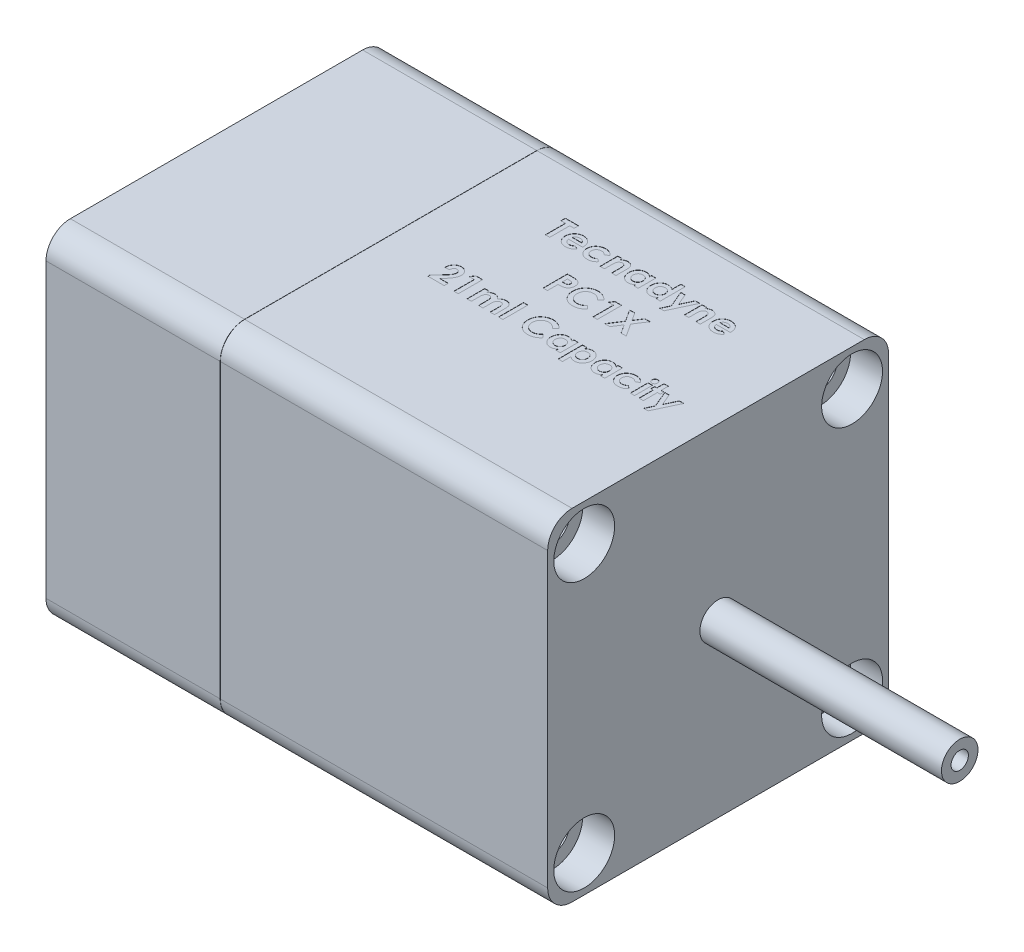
from build123d import *

# Parameters (mm, degrees)
BOSS_EXTRUDE1_DEPTH                            = 65.405
SKETCH2_R                                      = 2.38125
BOSS_EXTRUDE2_DEPTH                            = 31.496
SKETCH3_R                                      = 31.517825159
SKETCH3_R_2                                    = 14.576992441
CUT_EXTRUDE1_DEPTH                             = 0.0254
SKETCH4_W                                      = 0.569871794
SKETCH4_H                                      = 3.256410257
SKETCH4_W_2                                    = 0.569871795
SKETCH4_H_2                                    = 2.320192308
CUT_EXTRUDE2_DEPTH                             = 0.0254
F_3_8_24_TAPPED_HOLE1_D                        = 8.4328
F_3_8_24_TAPPED_HOLE1_DEPTH                    = 22.352
F_3_8_24_TAPPED_HOLE1_TIP                      = 2.533468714
CBORE_FOR_8_SOCKET_HEAD_CAP_SCREW1_D           = 4.4958
CBORE_FOR_8_SOCKET_HEAD_CAP_SCREW1_CBORE_D     = 7.9375
CBORE_FOR_8_SOCKET_HEAD_CAP_SCREW1_CBORE_DEPTH = 4.1656
SKETCH11_R                                     = 14.4399
SKETCH11_R_2                                   = 9.8679
CUT_EXTRUDE4_DEPTH                             = 2.54
F_4_40_TAPPED_HOLE1_D                          = 2.2606
F_4_40_TAPPED_HOLE1_DEPTH                      = 12.954
F_4_40_TAPPED_HOLE1_TIP                        = 0.679152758


with BuildPart() as part:
    # Sketch1 → Boss-Extrude1 (new body)
    with BuildSketch(Plane(origin=(0, 0, 0), x_dir=(0, 0, -1), z_dir=(1, 0, 0))):
        with BuildLine():
            Line((3.175, 0), (41.275, 0))
            ThreePointArc((41.275, 0), (43.52006403, 0.92993597), (44.45, 3.175))
            Line((44.45, 3.175), (44.45, 41.275))
            ThreePointArc((44.45, 41.275), (43.52006403, 43.52006403), (41.275, 44.45))
            Line((41.275, 44.45), (3.175, 44.45))
            ThreePointArc((3.175, 44.45), (0.92993597, 43.52006403), (0, 41.275))
            Line((0, 41.275), (0, 3.175))
            ThreePointArc((0, 3.175), (0.92993597, 0.92993597), (3.175, 0))
        make_face()
    extrude(amount=BOSS_EXTRUDE1_DEPTH)

    # Sketch2 → Boss-Extrude2 (add)
    with BuildSketch(Plane(origin=(65.405, 0, 0), x_dir=(0, 0, -1), z_dir=(1, 0, 0))):
        with Locations(Location((22.225, 22.225, 0), (0, 0, 180))):
            Circle(SKETCH2_R)
    extrude(amount=BOSS_EXTRUDE2_DEPTH)

    # Sketch3 → Cut-Extrude1 (cut)
    with BuildSketch(Plane(origin=(22.733, 0, 0), x_dir=(0, 0, -1), z_dir=(1, 0, 0))):
        with Locations((22.225, 22.225)):
            Circle(SKETCH3_R)
        with Locations((22.225, 22.225)):
            Circle(SKETCH3_R_2, mode=Mode.SUBTRACT)
    extrude(amount=-CUT_EXTRUDE1_DEPTH, mode=Mode.SUBTRACT)

    # Sketch4 → Cut-Extrude2 (cut)
    # profile 1 of 26: a face of its own
    with BuildSketch(Plane(origin=(0, 44.45, 0), x_dir=(1, 0, 0), z_dir=(0, 1, 0))):
        Polygon((32.211741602, 35.502510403), (33.921356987, 35.502510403), (33.921356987, 34.932638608), (33.351485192, 34.932638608), (33.351485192, 32.327510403), (32.781613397, 32.327510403), (32.781613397, 34.932638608), (32.211741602, 34.932638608), align=None)
    # profile 2 of 26: a face of its own
    with BuildSketch(Plane(origin=(0, 44.45, 0), x_dir=(1, 0, 0), z_dir=(0, 1, 0))):
        with BuildLine():
            Line((36.605987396, 33.345138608), (34.776164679, 33.345138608))
            add(Edge.make_bspline(
                [(34.776164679, 33.345138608), (34.77989554, 33.323877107), (34.787226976, 33.282096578), (34.803147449, 33.221406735), (34.823464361, 33.164213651), (34.8478129, 33.110440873), (34.875782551, 33.059804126), (34.908406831, 33.012540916), (34.945271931, 32.968692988), (34.986164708, 32.928450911), (35.030403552, 32.892393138), (35.077773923, 32.86080425), (35.128324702, 32.834903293), (35.181476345, 32.813071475), (35.237626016, 32.795778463), (35.296856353, 32.783851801), (35.359010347, 32.776806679), (35.401351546, 32.775787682), (35.422994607, 32.775266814)],
                knots=[0, 0, 0, 0, 1.091296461, 2.144483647, 3.168565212, 4.157007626, 5.126487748, 6.090021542, 7.05641414, 8.019231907, 8.98705074, 9.938580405, 10.892824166, 11.854447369, 12.841318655, 13.858982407, 14.905600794, 16, 16, 16, 16], degree=3))
            add(Edge.make_bspline(
                [(35.422994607, 32.775266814), (35.449119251, 32.775956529), (35.500566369, 32.777314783), (35.57593678, 32.789360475), (35.648830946, 32.807554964), (35.718559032, 32.834611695), (35.785928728, 32.86829257), (35.849830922, 32.910254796), (35.911371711, 32.959272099), (35.948918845, 32.997054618), (35.968061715, 33.016317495)],
                knots=[0, 0, 0, 0, 1.021034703, 2.010718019, 2.977989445, 3.954245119, 4.929443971, 5.918328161, 6.938689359, 8, 8, 8, 8], degree=3))
            Line((35.968061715, 33.016317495), (36.445074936, 32.789259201))
            add(Edge.make_bspline(
                [(36.445074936, 32.789259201), (36.430056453, 32.768505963), (36.400297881, 32.727384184), (36.351718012, 32.669515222), (36.301021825, 32.615521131), (36.248171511, 32.565757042), (36.193100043, 32.52036476), (36.135960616, 32.478791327), (36.075918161, 32.442152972), (36.014173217, 32.408677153), (35.949449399, 32.379978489), (35.881925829, 32.355505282), (35.811888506, 32.33338171), (35.73845301, 32.316524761), (35.662230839, 32.303180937), (35.583039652, 32.293705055), (35.500889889, 32.287852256), (35.445053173, 32.287158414), (35.416634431, 32.286805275)],
                knots=[0, 0, 0, 0, 1.028154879, 2.037251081, 3.030720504, 4.000128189, 4.949298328, 5.894184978, 6.834267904, 7.770992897, 8.712077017, 9.673380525, 10.653304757, 11.658697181, 12.695551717, 13.758623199, 14.859225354, 16, 16, 16, 16], degree=3))
            add(Edge.make_bspline(
                [(35.416634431, 32.286805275), (35.372912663, 32.28769663), (35.287286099, 32.289442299), (35.162041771, 32.305644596), (35.043094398, 32.332509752), (34.930108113, 32.369028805), (34.823571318, 32.417245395), (34.723431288, 32.476218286), (34.62868748, 32.544816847), (34.542234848, 32.624480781), (34.46347395, 32.711190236), (34.394295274, 32.804310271), (34.336407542, 32.903190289), (34.288868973, 33.007175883), (34.251920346, 33.116533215), (34.225282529, 33.231310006), (34.208953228, 33.351451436), (34.207189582, 33.433281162), (34.206292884, 33.474886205)],
                knots=[0, 0, 0, 0, 1.103565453, 2.161269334, 3.182010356, 4.179077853, 5.15417608, 6.128274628, 7.109042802, 8.101804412, 9.090965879, 10.063106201, 11.02526161, 11.978650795, 12.945248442, 13.93468508, 14.949922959, 16, 16, 16, 16], degree=3))
            add(Edge.make_bspline(
                [(34.206292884, 33.474886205), (34.207198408, 33.517548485), (34.208979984, 33.601484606), (34.225141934, 33.724400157), (34.251993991, 33.841678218), (34.289050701, 33.953480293), (34.335868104, 34.060156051), (34.394492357, 34.160772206), (34.46343962, 34.25567905), (34.541916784, 34.344432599), (34.628735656, 34.424542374), (34.72098891, 34.495936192), (34.819713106, 34.55542626), (34.923791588, 34.603494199), (35.032558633, 34.642548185), (35.147271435, 34.668535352), (35.267057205, 34.685984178), (35.34894012, 34.687591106), (35.390557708, 34.688407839)],
                knots=[0, 0, 0, 0, 1.079208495, 2.12329425, 3.130605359, 4.119693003, 5.099659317, 6.073216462, 7.060498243, 8.06384408, 9.066070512, 10.045757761, 11.010926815, 11.975797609, 12.942977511, 13.929384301, 14.947594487, 16, 16, 16, 16], degree=3))
            add(Edge.make_bspline(
                [(35.390557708, 34.688407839), (35.434488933, 34.687502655), (35.520743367, 34.68572542), (35.646859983, 34.669654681), (35.766597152, 34.642625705), (35.880465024, 34.606422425), (35.987009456, 34.556987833), (36.088571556, 34.499466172), (36.182715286, 34.429384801), (36.270444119, 34.350110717), (36.34963732, 34.262158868), (36.418860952, 34.166616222), (36.477761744, 34.06441522), (36.52550142, 33.955141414), (36.562412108, 33.839122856), (36.589074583, 33.716510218), (36.60527933, 33.58683714), (36.607010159, 33.498042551), (36.607895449, 33.452625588)],
                knots=[0, 0, 0, 0, 1.080001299, 2.120471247, 3.119684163, 4.095710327, 5.052285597, 6.002875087, 6.961153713, 7.931888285, 8.906493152, 9.865905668, 10.82813294, 11.801621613, 12.7925306, 13.817193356, 14.883530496, 16, 16, 16, 16], degree=3))
            Line((36.607895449, 33.452625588), (36.605987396, 33.345138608))
        make_face()
        with BuildLine():
            add(Edge.make_bspline(
                [(36.038023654, 33.792895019), (36.027269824, 33.821915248), (36.00588841, 33.879615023), (35.957588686, 33.959226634), (35.893496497, 34.028173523), (35.818952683, 34.08921275), (35.733781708, 34.138755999), (35.640667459, 34.174626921), (35.540786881, 34.196135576), (35.472074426, 34.198658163), (35.436986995, 34.199946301)],
                knots=[0, 0, 0, 0, 0.954238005, 1.897273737, 2.851915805, 3.847685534, 4.862635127, 5.880135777, 6.917509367, 8, 8, 8, 8], degree=3))
            add(Edge.make_bspline(
                [(35.436986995, 34.199946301), (35.398665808, 34.198708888), (35.323755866, 34.196290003), (35.215703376, 34.170564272), (35.113780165, 34.132169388), (35.053692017, 34.092583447), (35.023575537, 34.072742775)],
                knots=[0, 0, 0, 0, 1.044195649, 2.041185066, 3.018232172, 4, 4, 4, 4], degree=3))
            add(Edge.make_bspline(
                [(35.023575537, 34.072742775), (35.004785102, 34.057631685), (34.964724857, 34.025415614), (34.912698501, 33.961147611), (34.861452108, 33.883333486), (34.832315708, 33.82422816), (34.816869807, 33.792895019)],
                knots=[0, 0, 0, 0, 0.82159062, 1.751589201, 2.808063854, 4, 4, 4, 4], degree=3))
            Line((34.816869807, 33.792895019), (36.038023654, 33.792895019))
        make_face(mode=Mode.SUBTRACT)
    # profile 3 of 26: a face of its own
    with BuildSketch(Plane(origin=(0, 44.45, 0), x_dir=(1, 0, 0), z_dir=(0, 1, 0))):
        with BuildLine():
            Line((39.335139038, 34.174505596), (38.863213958, 33.915010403))
            add(Edge.make_bspline(
                [(38.863213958, 33.915010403), (38.841582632, 33.93667227), (38.800001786, 33.978311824), (38.733323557, 34.031020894), (38.667836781, 34.074662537), (38.600841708, 34.106867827), (38.531739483, 34.131121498), (38.458037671, 34.147185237), (38.378876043, 34.157762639), (38.324119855, 34.158738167), (38.295886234, 34.159241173)],
                knots=[0, 0, 0, 0, 1.150764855, 2.212059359, 3.192108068, 4.105322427, 5.000809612, 5.941206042, 6.938435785, 8, 8, 8, 8], degree=3))
            add(Edge.make_bspline(
                [(38.295886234, 34.159241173), (38.269994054, 34.158615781), (38.21932523, 34.157391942), (38.145290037, 34.148250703), (38.074927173, 34.133893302), (38.008362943, 34.112888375), (37.945715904, 34.085139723), (37.886467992, 34.052303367), (37.831194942, 34.013096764), (37.780678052, 33.968077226), (37.73507768, 33.918511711), (37.694399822, 33.86564796), (37.66107505, 33.808701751), (37.632263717, 33.749011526), (37.611081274, 33.68545617), (37.595583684, 33.618612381), (37.586750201, 33.548477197), (37.585470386, 33.500562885), (37.584818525, 33.47615824)],
                knots=[0, 0, 0, 0, 1.121765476, 2.195200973, 3.227634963, 4.230038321, 5.213228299, 6.192116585, 7.160777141, 8.14345191, 9.118668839, 10.075979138, 11.027630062, 11.972829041, 12.943187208, 13.923755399, 14.94248691, 16, 16, 16, 16], degree=3))
            add(Edge.make_bspline(
                [(37.584818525, 33.47615824), (37.585507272, 33.452390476), (37.586852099, 33.405982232), (37.595114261, 33.337797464), (37.609457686, 33.272888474), (37.630963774, 33.211598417), (37.656741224, 33.153362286), (37.689112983, 33.098643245), (37.727180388, 33.047202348), (37.771143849, 32.999486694), (37.819844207, 32.956572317), (37.872347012, 32.918674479), (37.928495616, 32.886544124), (37.988944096, 32.861329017), (38.052706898, 32.840783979), (38.120209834, 32.826155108), (38.19138107, 32.818035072), (38.239896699, 32.816670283), (38.26472137, 32.815971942)],
                knots=[0, 0, 0, 0, 1.070556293, 2.090336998, 3.088792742, 4.058148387, 5.011235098, 5.952916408, 6.915475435, 7.888633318, 8.869583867, 9.83422472, 10.800707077, 11.776204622, 12.778807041, 13.814557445, 14.881744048, 16, 16, 16, 16], degree=3))
            add(Edge.make_bspline(
                [(38.26472137, 32.815971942), (38.295286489, 32.816671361), (38.354945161, 32.818036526), (38.441671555, 32.829615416), (38.523279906, 32.848762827), (38.599778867, 32.875264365), (38.671061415, 32.90991562), (38.736944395, 32.952239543), (38.798105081, 33.001923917), (38.833770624, 33.040658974), (38.851765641, 33.060202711)],
                knots=[0, 0, 0, 0, 1.116373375, 2.178998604, 3.189797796, 4.174590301, 5.13072713, 6.078291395, 7.030403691, 8, 8, 8, 8], degree=3))
            Line((38.851765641, 33.060202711), (39.29443391, 32.756186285))
            add(Edge.make_bspline(
                [(39.29443391, 32.756186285), (39.263750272, 32.718671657), (39.203198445, 32.644639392), (39.097552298, 32.549214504), (38.983845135, 32.467223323), (38.859790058, 32.401779), (38.727193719, 32.349726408), (38.585020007, 32.312930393), (38.433509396, 32.291270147), (38.329454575, 32.288317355), (38.276169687, 32.286805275)],
                knots=[0, 0, 0, 0, 0.997876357, 1.969233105, 2.924898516, 3.881013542, 4.852507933, 5.855329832, 6.901747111, 8, 8, 8, 8], degree=3))
            add(Edge.make_bspline(
                [(38.276169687, 32.286805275), (38.228209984, 32.287913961), (38.134539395, 32.290079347), (37.99801684, 32.306662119), (37.869610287, 32.334593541), (37.749055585, 32.373384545), (37.636462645, 32.423633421), (37.532196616, 32.485960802), (37.435554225, 32.558632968), (37.348279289, 32.641993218), (37.270410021, 32.732731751), (37.202429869, 32.828293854), (37.143637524, 32.92696733), (37.097514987, 33.030394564), (37.059820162, 33.136963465), (37.034362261, 33.247947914), (37.017571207, 33.362433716), (37.015828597, 33.44005648), (37.014946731, 33.479338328)],
                knots=[0, 0, 0, 0, 1.183377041, 2.311265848, 3.387807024, 4.421911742, 5.431260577, 6.423665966, 7.413571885, 8.409103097, 9.395976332, 10.359992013, 11.300391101, 12.225292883, 13.150239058, 14.085544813, 15.031169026, 16, 16, 16, 16], degree=3))
            add(Edge.make_bspline(
                [(37.014946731, 33.479338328), (37.015419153, 33.506706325), (37.016354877, 33.560913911), (37.024342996, 33.641418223), (37.036769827, 33.720556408), (37.055445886, 33.797772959), (37.078414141, 33.873442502), (37.106335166, 33.947549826), (37.140310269, 34.019712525), (37.178209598, 34.090544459), (37.221404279, 34.158175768), (37.26852878, 34.222576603), (37.319516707, 34.28335254), (37.374967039, 34.339937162), (37.43449314, 34.392735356), (37.497229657, 34.442818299), (37.565206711, 34.487603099), (37.636061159, 34.529709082), (37.710403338, 34.567191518), (37.787378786, 34.599543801), (37.866392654, 34.627031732), (37.947634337, 34.649132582), (38.030755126, 34.667347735), (38.116494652, 34.67890782), (38.204143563, 34.687033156), (38.263430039, 34.687946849), (38.293342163, 34.688407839)],
                knots=[0, 0, 0, 0, 1.00272354, 1.986087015, 2.96193297, 3.936200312, 4.894695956, 5.858592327, 6.835334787, 7.815655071, 8.800643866, 9.773423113, 10.738352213, 11.705312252, 12.673769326, 13.65298065, 14.64420052, 15.654211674, 16.672258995, 17.692438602, 18.712115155, 19.735602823, 20.776372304, 21.827874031, 22.90408564, 24, 24, 24, 24], degree=3))
            add(Edge.make_bspline(
                [(38.293342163, 34.688407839), (38.321126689, 34.688093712), (38.375923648, 34.687474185), (38.45684637, 34.680996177), (38.535561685, 34.669992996), (38.612203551, 34.655436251), (38.687004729, 34.637397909), (38.758962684, 34.613353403), (38.829061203, 34.586063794), (38.919348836, 34.544859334), (39.025781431, 34.483355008), (39.142615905, 34.395144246), (39.246787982, 34.291950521), (39.305532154, 34.213861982), (39.335139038, 34.174505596)],
                knots=[0, 0, 0, 0, 0.826738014, 1.630502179, 2.413926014, 3.191023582, 3.95155221, 4.701751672, 5.446919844, 6.189438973, 7.653650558, 9.094719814, 10.535747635, 12, 12, 12, 12], degree=3))
        make_face()
    # profile 4 of 26: a face of its own
    with BuildSketch(Plane(origin=(0, 44.45, 0), x_dir=(1, 0, 0), z_dir=(0, 1, 0))):
        with BuildLine():
            Line((39.905010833, 34.647702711), (40.474882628, 34.647702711))
            Line((40.474882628, 34.647702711), (40.474882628, 34.402199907))
            add(Edge.make_bspline(
                [(40.474882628, 34.402199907), (40.507393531, 34.427487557), (40.569528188, 34.475817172), (40.663983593, 34.537437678), (40.753137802, 34.587871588), (40.838978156, 34.6262342), (40.923119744, 34.653834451), (41.0069253, 34.673663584), (41.091642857, 34.686360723), (41.14859362, 34.687725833), (41.17704609, 34.688407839)],
                knots=[0, 0, 0, 0, 1.276643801, 2.439914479, 3.493451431, 4.44993799, 5.350072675, 6.235028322, 7.118224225, 8, 8, 8, 8], degree=3))
            add(Edge.make_bspline(
                [(41.17704609, 34.688407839), (41.205907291, 34.687628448), (41.262564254, 34.686098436), (41.345988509, 34.675397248), (41.425692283, 34.655906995), (41.502571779, 34.630029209), (41.575844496, 34.595872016), (41.646408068, 34.555315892), (41.712746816, 34.505915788), (41.753601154, 34.468295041), (41.774266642, 34.449265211)],
                knots=[0, 0, 0, 0, 1.048836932, 2.058954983, 3.049370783, 4.026390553, 5.001981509, 5.982488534, 6.97947532, 8, 8, 8, 8], degree=3))
            add(Edge.make_bspline(
                [(41.774266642, 34.449265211), (41.790841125, 34.431630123), (41.824111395, 34.396230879), (41.865977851, 34.335653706), (41.901903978, 34.2696135), (41.931340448, 34.197348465), (41.953092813, 34.118461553), (41.969827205, 34.033905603), (41.979217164, 33.943207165), (41.980376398, 33.880898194), (41.980972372, 33.84886457)],
                knots=[0, 0, 0, 0, 0.889584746, 1.785680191, 2.700364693, 3.65222533, 4.649950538, 5.707241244, 6.821271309, 8, 8, 8, 8], degree=3))
            Line((41.980972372, 33.84886457), (41.980972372, 32.327510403))
            Line((41.980972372, 32.327510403), (41.411100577, 32.327510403))
            Line((41.411100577, 32.327510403), (41.411100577, 33.334962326))
            add(Edge.make_bspline(
                [(41.411100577, 33.334962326), (41.410980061, 33.367823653), (41.410749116, 33.430796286), (41.408975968, 33.520919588), (41.40551375, 33.602312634), (41.402358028, 33.675123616), (41.396162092, 33.739094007), (41.390574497, 33.794628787), (41.382000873, 33.841224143), (41.370845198, 33.891344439), (41.351364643, 33.945007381), (41.321122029, 34.001550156), (41.282755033, 34.049584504), (41.237830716, 34.08944717), (41.186398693, 34.120982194), (41.129080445, 34.143169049), (41.066183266, 34.156996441), (41.022357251, 34.158473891), (40.999597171, 34.159241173)],
                knots=[0, 0, 0, 0, 1.49886392, 2.872294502, 4.110984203, 5.214877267, 6.195405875, 7.042225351, 7.75923308, 8.355011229, 9.382752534, 10.352059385, 11.267231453, 12.171456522, 13.078624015, 14.003401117, 14.963110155, 16, 16, 16, 16], degree=3))
            add(Edge.make_bspline(
                [(40.999597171, 34.159241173), (40.96999673, 34.157740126), (40.912092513, 34.154803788), (40.828345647, 34.132661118), (40.751425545, 34.095002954), (40.681960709, 34.042891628), (40.620612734, 33.978553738), (40.570084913, 33.901823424), (40.52864172, 33.814552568), (40.510820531, 33.750830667), (40.501595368, 33.717844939)],
                knots=[0, 0, 0, 0, 0.984188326, 1.925263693, 2.85911992, 3.81709677, 4.80007086, 5.801799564, 6.862098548, 8, 8, 8, 8], degree=3))
            add(Edge.make_bspline(
                [(40.501595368, 33.717844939), (40.499302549, 33.707485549), (40.494189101, 33.684382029), (40.489983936, 33.645351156), (40.484134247, 33.599044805), (40.481942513, 33.54462496), (40.478131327, 33.482349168), (40.476721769, 33.41213504), (40.475309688, 33.334120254), (40.475029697, 33.27962989), (40.474882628, 33.251007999)],
                knots=[0, 0, 0, 0, 0.543362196, 1.211806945, 2.009705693, 2.934833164, 4.000995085, 5.207458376, 6.533175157, 8, 8, 8, 8], degree=3))
            Line((40.474882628, 33.251007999), (40.474882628, 32.327510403))
            Line((40.474882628, 32.327510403), (39.905010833, 32.327510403))
            Line((39.905010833, 32.327510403), (39.905010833, 34.647702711))
        make_face()
    # profile 5 of 26: a face of its own
    with BuildSketch(Plane(origin=(0, 44.45, 0), x_dir=(1, 0, 0), z_dir=(0, 1, 0))):
        with BuildLine():
            Line((44.301164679, 34.647702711), (44.871036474, 34.647702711))
            Line((44.871036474, 34.647702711), (44.871036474, 32.327510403))
            Line((44.871036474, 32.327510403), (44.301164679, 32.327510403))
            Line((44.301164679, 32.327510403), (44.301164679, 32.580645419))
            add(Edge.make_bspline(
                [(44.301164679, 32.580645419), (44.272927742, 32.556005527), (44.218125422, 32.508184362), (44.1317747, 32.446135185), (44.045171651, 32.394952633), (43.957900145, 32.354188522), (43.868618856, 32.324088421), (43.776684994, 32.302295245), (43.680774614, 32.289443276), (43.615576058, 32.287693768), (43.582464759, 32.286805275)],
                knots=[0, 0, 0, 0, 1.129196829, 2.191548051, 3.199897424, 4.157751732, 5.089409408, 6.034969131, 7.002052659, 8, 8, 8, 8], degree=3))
            add(Edge.make_bspline(
                [(43.582464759, 32.286805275), (43.545295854, 32.287641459), (43.471847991, 32.289293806), (43.364071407, 32.306687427), (43.260002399, 32.333312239), (43.159725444, 32.370989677), (43.063422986, 32.419812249), (42.97035802, 32.478506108), (42.882125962, 32.549131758), (42.797992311, 32.628633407), (42.720960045, 32.716085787), (42.653617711, 32.810275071), (42.596853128, 32.909865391), (42.550348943, 33.01452656), (42.513767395, 33.124181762), (42.487689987, 33.239178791), (42.472304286, 33.359558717), (42.47039997, 33.441556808), (42.46943391, 33.483154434)],
                knots=[0, 0, 0, 0, 0.980476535, 1.937477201, 2.874147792, 3.812856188, 4.758993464, 5.720109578, 6.712210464, 7.737600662, 8.772720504, 9.783789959, 10.789002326, 11.793715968, 12.802552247, 13.835794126, 14.902098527, 16, 16, 16, 16], degree=3))
            add(Edge.make_bspline(
                [(42.46943391, 33.483154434), (42.470447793, 33.52622883), (42.472436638, 33.610724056), (42.486984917, 33.734716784), (42.512581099, 33.852565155), (42.547483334, 33.964432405), (42.592378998, 34.070337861), (42.647058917, 34.17045503), (42.71226696, 34.264522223), (42.78740767, 34.350938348), (42.868541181, 34.430142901), (42.955339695, 34.499096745), (43.046445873, 34.557676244), (43.141956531, 34.605499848), (43.241858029, 34.642455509), (43.345755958, 34.669473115), (43.454111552, 34.685684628), (43.527924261, 34.687492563), (43.565292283, 34.688407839)],
                knots=[0, 0, 0, 0, 1.136281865, 2.228943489, 3.287578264, 4.313574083, 5.316051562, 6.317280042, 7.318008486, 8.329309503, 9.333984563, 10.305318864, 11.248632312, 12.186624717, 13.117503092, 14.05354244, 15.014596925, 16, 16, 16, 16], degree=3))
            add(Edge.make_bspline(
                [(43.565292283, 34.688407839), (43.59990718, 34.687688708), (43.668397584, 34.686265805), (43.76906861, 34.670815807), (43.866704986, 34.647448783), (43.960774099, 34.614154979), (44.052047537, 34.572114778), (44.138955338, 34.519435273), (44.22339869, 34.458330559), (44.274922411, 34.410606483), (44.301164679, 34.386299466)],
                knots=[0, 0, 0, 0, 1.017011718, 2.012299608, 2.98747302, 3.965332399, 4.941441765, 5.936729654, 6.94912688, 8, 8, 8, 8], degree=3))
            Line((44.301164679, 34.386299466), (44.301164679, 34.647702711))
        make_face()
        with BuildLine():
            add(Edge.make_bspline(
                [(43.684863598, 34.159241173), (43.662155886, 34.158544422), (43.617650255, 34.157178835), (43.552198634, 34.148964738), (43.489646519, 34.134491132), (43.430440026, 34.113109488), (43.373696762, 34.08706353), (43.320278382, 34.054441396), (43.269744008, 34.015882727), (43.222390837, 33.972321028), (43.179221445, 33.924438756), (43.14200691, 33.872188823), (43.110380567, 33.816979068), (43.0836329, 33.758643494), (43.06448764, 33.69649181), (43.049324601, 33.631333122), (43.041455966, 33.562635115), (43.04002963, 33.51581955), (43.039305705, 33.492058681)],
                knots=[0, 0, 0, 0, 1.04836806, 2.054732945, 3.03993516, 4.00574415, 4.955904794, 5.917688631, 6.888591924, 7.88601754, 8.884115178, 9.859153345, 10.841239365, 11.818093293, 12.814750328, 13.83810466, 14.90274714, 16, 16, 16, 16], degree=3))
            add(Edge.make_bspline(
                [(43.039305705, 33.492058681), (43.040018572, 33.468082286), (43.041423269, 33.42083708), (43.049451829, 33.351559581), (43.064069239, 33.285449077), (43.085395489, 33.223040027), (43.111439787, 33.163490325), (43.143141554, 33.1070748), (43.182081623, 33.054790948), (43.225288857, 33.005401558), (43.273613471, 32.961298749), (43.324433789, 32.922139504), (43.378443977, 32.889374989), (43.435058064, 32.8628945), (43.494085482, 32.841315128), (43.556266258, 32.827023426), (43.620991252, 32.817887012), (43.665115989, 32.816614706), (43.687407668, 32.815971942)],
                knots=[0, 0, 0, 0, 1.099136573, 2.165835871, 3.191374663, 4.196217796, 5.183857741, 6.167377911, 7.154730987, 8.166690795, 9.170734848, 10.148332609, 11.103258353, 12.059567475, 13.009337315, 13.978056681, 14.978520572, 16, 16, 16, 16], degree=3))
            add(Edge.make_bspline(
                [(43.687407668, 32.815971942), (43.710538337, 32.816672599), (43.755887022, 32.818046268), (43.822406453, 32.826185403), (43.885798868, 32.840712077), (43.945800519, 32.862216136), (44.003327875, 32.888075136), (44.057861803, 32.920059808), (44.108810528, 32.958529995), (44.156432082, 33.002485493), (44.200068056, 33.050758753), (44.237797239, 33.103693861), (44.270660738, 33.159597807), (44.296506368, 33.219792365), (44.317031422, 33.28322441), (44.331757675, 33.350287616), (44.339767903, 33.421054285), (44.341160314, 33.469355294), (44.341869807, 33.493966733)],
                knots=[0, 0, 0, 0, 1.050008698, 2.058587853, 3.036635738, 3.995319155, 4.947022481, 5.895997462, 6.858296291, 7.838991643, 8.833936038, 9.806048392, 10.784806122, 11.771666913, 12.772873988, 13.80724452, 14.882696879, 16, 16, 16, 16], degree=3))
            add(Edge.make_bspline(
                [(44.341869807, 33.493966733), (44.34116913, 33.518154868), (44.339800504, 33.56540132), (44.331723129, 33.634690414), (44.316892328, 33.700436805), (44.296789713, 33.762761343), (44.270484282, 33.821521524), (44.237595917, 33.876065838), (44.200280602, 33.92828404), (44.156161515, 33.975253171), (44.108797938, 34.018890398), (44.057099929, 34.056197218), (44.002696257, 34.088349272), (43.945252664, 34.114747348), (43.884237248, 34.134098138), (43.8207365, 34.149080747), (43.753759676, 34.157173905), (43.708203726, 34.158540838), (43.684863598, 34.159241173)],
                knots=[0, 0, 0, 0, 1.106611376, 2.161533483, 3.185006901, 4.184773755, 5.152708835, 6.122342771, 7.094156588, 8.082475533, 9.064254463, 10.03606828, 10.992420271, 11.951521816, 12.920622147, 13.915721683, 14.932141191, 16, 16, 16, 16], degree=3))
        make_face(mode=Mode.SUBTRACT)
    # profile 6 of 26: a face of its own
    with BuildSketch(Plane(origin=(0, 44.45, 0), x_dir=(1, 0, 0), z_dir=(0, 1, 0))):
        with BuildLine():
            Line((47.191228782, 35.58392066), (47.761100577, 35.58392066))
            Line((47.761100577, 35.58392066), (47.761100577, 32.327510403))
            Line((47.761100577, 32.327510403), (47.191228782, 32.327510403))
            Line((47.191228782, 32.327510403), (47.191228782, 32.580645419))
            add(Edge.make_bspline(
                [(47.191228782, 32.580645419), (47.162991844, 32.556005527), (47.108189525, 32.508184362), (47.021838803, 32.446135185), (46.935235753, 32.394952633), (46.847964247, 32.354188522), (46.758682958, 32.324088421), (46.666749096, 32.302295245), (46.570838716, 32.289443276), (46.505640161, 32.287693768), (46.472528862, 32.286805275)],
                knots=[0, 0, 0, 0, 1.129196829, 2.191548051, 3.199897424, 4.157751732, 5.089409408, 6.034969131, 7.002052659, 8, 8, 8, 8], degree=3))
            add(Edge.make_bspline(
                [(46.472528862, 32.286805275), (46.435359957, 32.287641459), (46.361912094, 32.289293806), (46.254135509, 32.306687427), (46.150066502, 32.333312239), (46.049789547, 32.370989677), (45.953487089, 32.419812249), (45.860422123, 32.478506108), (45.772190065, 32.549131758), (45.688056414, 32.628633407), (45.611024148, 32.716085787), (45.543681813, 32.810275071), (45.48691723, 32.909865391), (45.440413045, 33.01452656), (45.403831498, 33.124181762), (45.377754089, 33.239178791), (45.362368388, 33.359558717), (45.360464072, 33.441556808), (45.359498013, 33.483154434)],
                knots=[0, 0, 0, 0, 0.980476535, 1.937477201, 2.874147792, 3.812856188, 4.758993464, 5.720109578, 6.712210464, 7.737600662, 8.772720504, 9.783789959, 10.789002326, 11.793715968, 12.802552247, 13.835794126, 14.902098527, 16, 16, 16, 16], degree=3))
            add(Edge.make_bspline(
                [(45.359498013, 33.483154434), (45.360511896, 33.52622883), (45.36250074, 33.610724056), (45.377049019, 33.734716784), (45.402645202, 33.852565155), (45.437547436, 33.964432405), (45.4824431, 34.070337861), (45.537123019, 34.17045503), (45.602331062, 34.264522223), (45.677471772, 34.350938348), (45.758605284, 34.430142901), (45.845403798, 34.499096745), (45.936509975, 34.557676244), (46.032020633, 34.605499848), (46.131922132, 34.642455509), (46.235820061, 34.669473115), (46.344175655, 34.685684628), (46.417988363, 34.687492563), (46.455356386, 34.688407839)],
                knots=[0, 0, 0, 0, 1.136281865, 2.228943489, 3.287578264, 4.313574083, 5.316051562, 6.317280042, 7.318008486, 8.329309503, 9.333984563, 10.305318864, 11.248632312, 12.186624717, 13.117503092, 14.05354244, 15.014596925, 16, 16, 16, 16], degree=3))
            add(Edge.make_bspline(
                [(46.455356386, 34.688407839), (46.489948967, 34.687310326), (46.558355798, 34.685139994), (46.65940447, 34.671478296), (46.756632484, 34.645754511), (46.85122067, 34.612611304), (46.94194062, 34.568011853), (47.029279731, 34.514437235), (47.113468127, 34.451207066), (47.164980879, 34.402310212), (47.191228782, 34.377395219)],
                knots=[0, 0, 0, 0, 1.011899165, 2.001030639, 2.974036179, 3.948778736, 4.92769327, 5.924124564, 6.942254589, 8, 8, 8, 8], degree=3))
            Line((47.191228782, 34.377395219), (47.191228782, 35.58392066))
        make_face()
        with BuildLine():
            add(Edge.make_bspline(
                [(46.5749277, 34.159241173), (46.552219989, 34.158544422), (46.507714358, 34.157178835), (46.442262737, 34.148964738), (46.379710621, 34.134491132), (46.320504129, 34.113109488), (46.263760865, 34.08706353), (46.210342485, 34.054441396), (46.15980811, 34.015882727), (46.11245494, 33.972321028), (46.069285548, 33.924438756), (46.032071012, 33.872188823), (46.000444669, 33.816979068), (45.973697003, 33.758643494), (45.954551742, 33.69649181), (45.939388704, 33.631333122), (45.931520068, 33.562635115), (45.930093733, 33.51581955), (45.929369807, 33.492058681)],
                knots=[0, 0, 0, 0, 1.04836806, 2.054732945, 3.03993516, 4.00574415, 4.955904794, 5.917688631, 6.888591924, 7.88601754, 8.884115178, 9.859153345, 10.841239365, 11.818093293, 12.814750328, 13.83810466, 14.90274714, 16, 16, 16, 16], degree=3))
            add(Edge.make_bspline(
                [(45.929369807, 33.492058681), (45.930082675, 33.468082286), (45.931487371, 33.42083708), (45.939515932, 33.351559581), (45.954133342, 33.285449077), (45.975459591, 33.223040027), (46.001503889, 33.163490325), (46.033205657, 33.1070748), (46.072145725, 33.054790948), (46.11535296, 33.005401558), (46.163677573, 32.961298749), (46.214497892, 32.922139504), (46.26850808, 32.889374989), (46.325122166, 32.8628945), (46.384149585, 32.841315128), (46.446330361, 32.827023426), (46.511055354, 32.817887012), (46.555180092, 32.816614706), (46.577471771, 32.815971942)],
                knots=[0, 0, 0, 0, 1.099136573, 2.165835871, 3.191374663, 4.196217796, 5.183857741, 6.167377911, 7.154730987, 8.166690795, 9.170734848, 10.148332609, 11.103258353, 12.059567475, 13.009337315, 13.978056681, 14.978520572, 16, 16, 16, 16], degree=3))
            add(Edge.make_bspline(
                [(46.577471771, 32.815971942), (46.600602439, 32.816672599), (46.645951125, 32.818046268), (46.712470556, 32.826185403), (46.77586297, 32.840712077), (46.835864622, 32.862216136), (46.893391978, 32.888075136), (46.947925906, 32.920059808), (46.998874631, 32.958529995), (47.046496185, 33.002485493), (47.090132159, 33.050758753), (47.127861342, 33.103693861), (47.16072484, 33.159597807), (47.18657047, 33.219792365), (47.207095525, 33.28322441), (47.221821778, 33.350287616), (47.229832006, 33.421054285), (47.231224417, 33.469355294), (47.23193391, 33.493966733)],
                knots=[0, 0, 0, 0, 1.050008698, 2.058587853, 3.036635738, 3.995319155, 4.947022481, 5.895997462, 6.858296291, 7.838991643, 8.833936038, 9.806048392, 10.784806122, 11.771666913, 12.772873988, 13.80724452, 14.882696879, 16, 16, 16, 16], degree=3))
            add(Edge.make_bspline(
                [(47.23193391, 33.493966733), (47.231233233, 33.518154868), (47.229864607, 33.56540132), (47.221787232, 33.634690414), (47.206956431, 33.700436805), (47.186853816, 33.762761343), (47.160548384, 33.821521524), (47.12766002, 33.876065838), (47.090344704, 33.92828404), (47.046225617, 33.975253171), (46.99886204, 34.018890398), (46.947164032, 34.056197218), (46.892760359, 34.088349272), (46.835316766, 34.114747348), (46.77430135, 34.134098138), (46.710800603, 34.149080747), (46.643823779, 34.157173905), (46.598267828, 34.158540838), (46.5749277, 34.159241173)],
                knots=[0, 0, 0, 0, 1.106611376, 2.161533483, 3.185006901, 4.184773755, 5.152708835, 6.122342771, 7.094156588, 8.082475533, 9.064254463, 10.03606828, 10.992420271, 11.951521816, 12.920622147, 13.915721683, 14.932141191, 16, 16, 16, 16], degree=3))
        make_face(mode=Mode.SUBTRACT)
    # profile 7 of 26: a face of its own
    with BuildSketch(Plane(origin=(0, 44.45, 0), x_dir=(1, 0, 0), z_dir=(0, 1, 0))):
        Polygon((48.105822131, 34.647702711), (48.676329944, 34.647702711), (49.309803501, 33.154969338), (50.010694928, 34.647702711), (50.590106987, 34.647702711), (49.098645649, 31.472702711), (48.51923359, 31.472702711), (49.009603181, 32.516407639), align=None)
    # profile 8 of 26: a face of its own
    with BuildSketch(Plane(origin=(0, 44.45, 0), x_dir=(1, 0, 0), z_dir=(0, 1, 0))):
        with BuildLine():
            Line((50.895395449, 34.647702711), (51.465267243, 34.647702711))
            Line((51.465267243, 34.647702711), (51.465267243, 34.402199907))
            add(Edge.make_bspline(
                [(51.465267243, 34.402199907), (51.497778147, 34.427487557), (51.559912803, 34.475817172), (51.654368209, 34.537437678), (51.743522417, 34.587871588), (51.829362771, 34.6262342), (51.913504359, 34.653834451), (51.997309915, 34.673663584), (52.082027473, 34.686360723), (52.138978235, 34.687725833), (52.167430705, 34.688407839)],
                knots=[0, 0, 0, 0, 1.276643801, 2.439914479, 3.493451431, 4.44993799, 5.350072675, 6.235028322, 7.118224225, 8, 8, 8, 8], degree=3))
            add(Edge.make_bspline(
                [(52.167430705, 34.688407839), (52.196291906, 34.687628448), (52.252948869, 34.686098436), (52.336373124, 34.675397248), (52.416076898, 34.655906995), (52.492956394, 34.630029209), (52.566229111, 34.595872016), (52.636792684, 34.555315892), (52.703131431, 34.505915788), (52.743985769, 34.468295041), (52.764651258, 34.449265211)],
                knots=[0, 0, 0, 0, 1.048836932, 2.058954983, 3.049370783, 4.026390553, 5.001981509, 5.982488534, 6.97947532, 8, 8, 8, 8], degree=3))
            add(Edge.make_bspline(
                [(52.764651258, 34.449265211), (52.78122574, 34.431630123), (52.814496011, 34.396230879), (52.856362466, 34.335653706), (52.892288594, 34.2696135), (52.921725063, 34.197348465), (52.943477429, 34.118461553), (52.96021182, 34.033905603), (52.969601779, 33.943207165), (52.970761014, 33.880898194), (52.971356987, 33.84886457)],
                knots=[0, 0, 0, 0, 0.889584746, 1.785680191, 2.700364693, 3.65222533, 4.649950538, 5.707241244, 6.821271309, 8, 8, 8, 8], degree=3))
            Line((52.971356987, 33.84886457), (52.971356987, 32.327510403))
            Line((52.971356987, 32.327510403), (52.401485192, 32.327510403))
            Line((52.401485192, 32.327510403), (52.401485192, 33.334962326))
            add(Edge.make_bspline(
                [(52.401485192, 33.334962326), (52.401364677, 33.367823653), (52.401133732, 33.430796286), (52.399360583, 33.520919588), (52.395898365, 33.602312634), (52.392742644, 33.675123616), (52.386546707, 33.739094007), (52.380959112, 33.794628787), (52.372385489, 33.841224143), (52.361229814, 33.891344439), (52.341749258, 33.945007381), (52.311506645, 34.001550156), (52.273139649, 34.049584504), (52.228215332, 34.08944717), (52.176783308, 34.120982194), (52.11946506, 34.143169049), (52.056567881, 34.156996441), (52.012741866, 34.158473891), (51.989981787, 34.159241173)],
                knots=[0, 0, 0, 0, 1.49886392, 2.872294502, 4.110984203, 5.214877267, 6.195405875, 7.042225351, 7.75923308, 8.355011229, 9.382752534, 10.352059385, 11.267231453, 12.171456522, 13.078624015, 14.003401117, 14.963110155, 16, 16, 16, 16], degree=3))
            add(Edge.make_bspline(
                [(51.989981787, 34.159241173), (51.960381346, 34.157740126), (51.902477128, 34.154803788), (51.818730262, 34.132661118), (51.741810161, 34.095002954), (51.672345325, 34.042891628), (51.610997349, 33.978553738), (51.560469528, 33.901823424), (51.519026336, 33.814552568), (51.501205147, 33.750830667), (51.491979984, 33.717844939)],
                knots=[0, 0, 0, 0, 0.984188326, 1.925263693, 2.85911992, 3.81709677, 4.80007086, 5.801799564, 6.862098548, 8, 8, 8, 8], degree=3))
            add(Edge.make_bspline(
                [(51.491979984, 33.717844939), (51.489687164, 33.707485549), (51.484573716, 33.684382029), (51.480368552, 33.645351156), (51.474518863, 33.599044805), (51.472327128, 33.54462496), (51.468515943, 33.482349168), (51.467106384, 33.41213504), (51.465694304, 33.334120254), (51.465414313, 33.27962989), (51.465267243, 33.251007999)],
                knots=[0, 0, 0, 0, 0.543362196, 1.211806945, 2.009705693, 2.934833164, 4.000995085, 5.207458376, 6.533175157, 8, 8, 8, 8], degree=3))
            Line((51.465267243, 33.251007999), (51.465267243, 32.327510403))
            Line((51.465267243, 32.327510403), (50.895395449, 32.327510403))
            Line((50.895395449, 32.327510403), (50.895395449, 34.647702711))
        make_face()
    # profile 9 of 26: a face of its own
    with BuildSketch(Plane(origin=(0, 44.45, 0), x_dir=(1, 0, 0), z_dir=(0, 1, 0))):
        with BuildLine():
            Line((55.859513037, 33.345138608), (54.02969032, 33.345138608))
            add(Edge.make_bspline(
                [(54.02969032, 33.345138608), (54.033421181, 33.323877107), (54.040752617, 33.282096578), (54.05667309, 33.221406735), (54.076990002, 33.164213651), (54.101338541, 33.110440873), (54.129308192, 33.059804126), (54.161932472, 33.012540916), (54.198797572, 32.968692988), (54.239690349, 32.928450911), (54.283929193, 32.892393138), (54.331299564, 32.86080425), (54.381850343, 32.834903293), (54.435001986, 32.813071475), (54.491151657, 32.795778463), (54.550381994, 32.783851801), (54.612535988, 32.776806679), (54.654877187, 32.775787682), (54.676520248, 32.775266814)],
                knots=[0, 0, 0, 0, 1.091296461, 2.144483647, 3.168565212, 4.157007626, 5.126487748, 6.090021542, 7.05641414, 8.019231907, 8.98705074, 9.938580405, 10.892824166, 11.854447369, 12.841318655, 13.858982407, 14.905600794, 16, 16, 16, 16], degree=3))
            add(Edge.make_bspline(
                [(54.676520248, 32.775266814), (54.702644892, 32.775956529), (54.75409201, 32.777314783), (54.829462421, 32.789360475), (54.902356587, 32.807554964), (54.972084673, 32.834611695), (55.039454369, 32.86829257), (55.103356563, 32.910254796), (55.164897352, 32.959272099), (55.202444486, 32.997054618), (55.221587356, 33.016317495)],
                knots=[0, 0, 0, 0, 1.021034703, 2.010718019, 2.977989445, 3.954245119, 4.929443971, 5.918328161, 6.938689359, 8, 8, 8, 8], degree=3))
            Line((55.221587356, 33.016317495), (55.698600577, 32.789259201))
            add(Edge.make_bspline(
                [(55.698600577, 32.789259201), (55.683582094, 32.768505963), (55.653823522, 32.727384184), (55.605243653, 32.669515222), (55.554547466, 32.615521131), (55.501697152, 32.565757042), (55.446625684, 32.52036476), (55.389486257, 32.478791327), (55.329443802, 32.442152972), (55.267698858, 32.408677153), (55.20297504, 32.379978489), (55.13545147, 32.355505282), (55.065414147, 32.33338171), (54.991978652, 32.316524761), (54.91575648, 32.303180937), (54.836565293, 32.293705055), (54.75441553, 32.287852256), (54.698578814, 32.287158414), (54.670160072, 32.286805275)],
                knots=[0, 0, 0, 0, 1.028154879, 2.037251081, 3.030720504, 4.000128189, 4.949298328, 5.894184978, 6.834267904, 7.770992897, 8.712077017, 9.673380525, 10.653304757, 11.658697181, 12.695551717, 13.758623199, 14.859225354, 16, 16, 16, 16], degree=3))
            add(Edge.make_bspline(
                [(54.670160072, 32.286805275), (54.626438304, 32.28769663), (54.54081174, 32.289442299), (54.415567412, 32.305644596), (54.296620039, 32.332509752), (54.183633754, 32.369028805), (54.077096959, 32.417245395), (53.976956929, 32.476218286), (53.882213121, 32.544816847), (53.795760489, 32.624480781), (53.716999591, 32.711190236), (53.647820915, 32.804310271), (53.589933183, 32.903190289), (53.542394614, 33.007175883), (53.505445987, 33.116533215), (53.47880817, 33.231310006), (53.462478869, 33.351451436), (53.460715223, 33.433281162), (53.459818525, 33.474886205)],
                knots=[0, 0, 0, 0, 1.103565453, 2.161269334, 3.182010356, 4.179077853, 5.15417608, 6.128274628, 7.109042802, 8.101804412, 9.090965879, 10.063106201, 11.02526161, 11.978650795, 12.945248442, 13.93468508, 14.949922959, 16, 16, 16, 16], degree=3))
            add(Edge.make_bspline(
                [(53.459818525, 33.474886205), (53.460724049, 33.517548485), (53.462505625, 33.601484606), (53.478667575, 33.724400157), (53.505519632, 33.841678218), (53.542576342, 33.953480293), (53.589393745, 34.060156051), (53.648017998, 34.160772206), (53.716965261, 34.25567905), (53.795442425, 34.344432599), (53.882261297, 34.424542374), (53.974514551, 34.495936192), (54.073238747, 34.55542626), (54.177317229, 34.603494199), (54.286084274, 34.642548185), (54.400797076, 34.668535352), (54.520582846, 34.685984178), (54.602465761, 34.687591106), (54.644083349, 34.688407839)],
                knots=[0, 0, 0, 0, 1.079208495, 2.12329425, 3.130605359, 4.119693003, 5.099659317, 6.073216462, 7.060498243, 8.06384408, 9.066070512, 10.045757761, 11.010926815, 11.975797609, 12.942977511, 13.929384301, 14.947594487, 16, 16, 16, 16], degree=3))
            add(Edge.make_bspline(
                [(54.644083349, 34.688407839), (54.688014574, 34.687502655), (54.774269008, 34.68572542), (54.900385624, 34.669654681), (55.020122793, 34.642625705), (55.133990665, 34.606422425), (55.240535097, 34.556987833), (55.342097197, 34.499466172), (55.436240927, 34.429384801), (55.52396976, 34.350110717), (55.603162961, 34.262158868), (55.672386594, 34.166616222), (55.731287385, 34.06441522), (55.779027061, 33.955141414), (55.815937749, 33.839122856), (55.842600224, 33.716510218), (55.858804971, 33.58683714), (55.8605358, 33.498042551), (55.86142109, 33.452625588)],
                knots=[0, 0, 0, 0, 1.080001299, 2.120471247, 3.119684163, 4.095710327, 5.052285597, 6.002875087, 6.961153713, 7.931888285, 8.906493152, 9.865905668, 10.82813294, 11.801621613, 12.7925306, 13.817193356, 14.883530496, 16, 16, 16, 16], degree=3))
            Line((55.86142109, 33.452625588), (55.859513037, 33.345138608))
        make_face()
        with BuildLine():
            add(Edge.make_bspline(
                [(55.291549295, 33.792895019), (55.280795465, 33.821915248), (55.259414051, 33.879615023), (55.211114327, 33.959226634), (55.147022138, 34.028173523), (55.072478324, 34.08921275), (54.987307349, 34.138755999), (54.8941931, 34.174626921), (54.794312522, 34.196135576), (54.725600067, 34.198658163), (54.690512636, 34.199946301)],
                knots=[0, 0, 0, 0, 0.954238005, 1.897273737, 2.851915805, 3.847685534, 4.862635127, 5.880135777, 6.917509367, 8, 8, 8, 8], degree=3))
            add(Edge.make_bspline(
                [(54.690512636, 34.199946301), (54.652191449, 34.198708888), (54.577281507, 34.196290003), (54.469229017, 34.170564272), (54.367305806, 34.132169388), (54.307217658, 34.092583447), (54.277101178, 34.072742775)],
                knots=[0, 0, 0, 0, 1.044195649, 2.041185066, 3.018232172, 4, 4, 4, 4], degree=3))
            add(Edge.make_bspline(
                [(54.277101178, 34.072742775), (54.258310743, 34.057631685), (54.218250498, 34.025415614), (54.166224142, 33.961147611), (54.114977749, 33.883333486), (54.085841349, 33.82422816), (54.070395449, 33.792895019)],
                knots=[0, 0, 0, 0, 0.82159062, 1.751589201, 2.808063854, 4, 4, 4, 4], degree=3))
            Line((54.070395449, 33.792895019), (55.291549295, 33.792895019))
        make_face(mode=Mode.SUBTRACT)
    # profile 10 of 26: a face of its own
    with BuildSketch(Plane(origin=(0, 44.45, 0), x_dir=(1, 0, 0), z_dir=(0, 1, 0))):
        with BuildLine():
            Line((38.643151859, 29.332959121), (39.279169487, 29.332959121))
            add(Edge.make_bspline(
                [(39.279169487, 29.332959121), (39.320726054, 29.332773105), (39.400897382, 29.332414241), (39.516511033, 29.328062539), (39.623170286, 29.320264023), (39.720850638, 29.31062629), (39.809511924, 29.297114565), (39.889265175, 29.281624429), (39.960126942, 29.262752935), (40.022896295, 29.240352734), (40.079229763, 29.213943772), (40.132539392, 29.185816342), (40.18162038, 29.152247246), (40.228949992, 29.11685442), (40.271822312, 29.076256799), (40.312911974, 29.033156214), (40.350478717, 28.985843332), (40.384696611, 28.934890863), (40.415737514, 28.881240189), (40.442856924, 28.8247954), (40.46485467, 28.765467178), (40.483308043, 28.703639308), (40.498129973, 28.639314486), (40.507995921, 28.572097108), (40.51469737, 28.502456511), (40.51528868, 28.455059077), (40.515587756, 28.431086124)],
                knots=[0, 0, 0, 0, 1.698747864, 3.27724071, 4.728299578, 6.070144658, 7.288476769, 8.393259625, 9.389771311, 10.283485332, 11.113357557, 11.931608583, 12.74405601, 13.541433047, 14.344816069, 15.154114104, 15.974336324, 16.810834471, 17.661136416, 18.50621059, 19.367396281, 20.244825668, 21.142564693, 22.063065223, 23.020325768, 24, 24, 24, 24], degree=3))
            add(Edge.make_bspline(
                [(40.515587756, 28.431086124), (40.51515503, 28.404565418), (40.51430467, 28.352448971), (40.505968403, 28.276052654), (40.491727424, 28.203215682), (40.473115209, 28.133323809), (40.4471618, 28.06752691), (40.417511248, 28.004255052), (40.381031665, 27.945282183), (40.339347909, 27.889870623), (40.293824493, 27.837569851), (40.243380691, 27.789889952), (40.188977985, 27.746505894), (40.130931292, 27.706963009), (40.069022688, 27.671341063), (40.003296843, 27.639306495), (39.933304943, 27.61188387), (39.88456469, 27.597542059), (39.859853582, 27.59027082)],
                knots=[0, 0, 0, 0, 1.102006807, 2.165578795, 3.188629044, 4.184801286, 5.166646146, 6.124351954, 7.085497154, 8.042432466, 9.003981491, 9.963833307, 10.922997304, 11.89326795, 12.880200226, 13.889073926, 14.929769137, 16, 16, 16, 16], degree=3))
            add(Edge.make_bspline(
                [(39.859853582, 27.59027082), (39.843577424, 27.586221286), (39.808318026, 27.57744869), (39.749973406, 27.568542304), (39.682737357, 27.56035343), (39.606392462, 27.553316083), (39.520894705, 27.548532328), (39.426326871, 27.544796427), (39.322646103, 27.542080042), (39.250550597, 27.541983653), (39.213023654, 27.54193348)],
                knots=[0, 0, 0, 0, 0.618981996, 1.340914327, 2.176866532, 3.120127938, 4.170906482, 5.338178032, 6.614476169, 8, 8, 8, 8], degree=3))
            Line((39.213023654, 27.54193348), (39.213023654, 26.157959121))
            Line((39.213023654, 26.157959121), (38.643151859, 26.157959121))
            Line((38.643151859, 26.157959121), (38.643151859, 29.332959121))
        make_face()
        with BuildLine():
            Line((39.213023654, 28.111805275), (39.414641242, 28.111805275))
            add(Edge.make_bspline(
                [(39.414641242, 28.111805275), (39.451328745, 28.112037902), (39.518834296, 28.11246594), (39.61102304, 28.118655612), (39.685107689, 28.128108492), (39.743635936, 28.141666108), (39.789849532, 28.162241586), (39.829705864, 28.186043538), (39.863891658, 28.216140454), (39.893491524, 28.25053133), (39.917155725, 28.290048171), (39.933565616, 28.33404752), (39.944225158, 28.381604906), (39.945209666, 28.414701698), (39.945715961, 28.431722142)],
                knots=[0, 0, 0, 0, 1.8619151, 3.425951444, 4.686033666, 5.651700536, 6.461346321, 7.243864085, 7.999046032, 8.762387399, 9.539336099, 10.322741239, 11.137448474, 12, 12, 12, 12], degree=3))
            add(Edge.make_bspline(
                [(39.945715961, 28.431722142), (39.945214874, 28.446592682), (39.944242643, 28.475445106), (39.937100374, 28.51708631), (39.925717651, 28.555904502), (39.909224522, 28.591494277), (39.887902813, 28.623795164), (39.861907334, 28.652794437), (39.831571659, 28.679113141), (39.808150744, 28.693044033), (39.796251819, 28.700121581)],
                knots=[0, 0, 0, 0, 1.102301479, 2.1387299, 3.123554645, 4.094223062, 5.036071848, 5.982632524, 6.975082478, 8, 8, 8, 8], degree=3))
            add(Edge.make_bspline(
                [(39.796251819, 28.700121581), (39.786172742, 28.705218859), (39.76483327, 28.716010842), (39.728490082, 28.728557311), (39.686550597, 28.739141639), (39.638731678, 28.74792653), (39.585224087, 28.754744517), (39.526037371, 28.759958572), (39.461084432, 28.762055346), (39.415913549, 28.762733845), (39.392380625, 28.763087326)],
                knots=[0, 0, 0, 0, 0.656809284, 1.390599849, 2.23162475, 3.173112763, 4.218524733, 5.370385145, 6.63003504, 8, 8, 8, 8], degree=3))
            Line((39.392380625, 28.763087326), (39.213023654, 28.763087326))
            Line((39.213023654, 28.763087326), (39.213023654, 28.111805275))
        make_face(mode=Mode.SUBTRACT)
    # profile 11 of 26: a face of its own
    with BuildSketch(Plane(origin=(0, 44.45, 0), x_dir=(1, 0, 0), z_dir=(0, 1, 0))):
        with BuildLine():
            Line((43.934818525, 28.782167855), (43.516954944, 28.382748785))
            add(Edge.make_bspline(
                [(43.516954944, 28.382748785), (43.48150835, 28.419400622), (43.412270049, 28.490993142), (43.300701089, 28.585775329), (43.184673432, 28.664763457), (43.066444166, 28.731286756), (42.943886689, 28.781616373), (42.818418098, 28.818292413), (42.68923724, 28.840652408), (42.601812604, 28.843210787), (42.55784036, 28.844497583)],
                knots=[0, 0, 0, 0, 1.115251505, 2.178435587, 3.19620269, 4.182487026, 5.141301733, 6.088180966, 7.038406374, 8, 8, 8, 8], degree=3))
            add(Edge.make_bspline(
                [(42.55784036, 28.844497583), (42.521118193, 28.843480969), (42.448651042, 28.841474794), (42.342250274, 28.826767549), (42.240472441, 28.801757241), (42.142969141, 28.767288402), (42.050027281, 28.722687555), (41.961451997, 28.667989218), (41.877461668, 28.603687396), (41.799165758, 28.530114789), (41.727543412, 28.449731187), (41.664260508, 28.363962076), (41.611250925, 28.273003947), (41.567746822, 28.177777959), (41.533858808, 28.077843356), (41.509658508, 27.973267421), (41.495661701, 27.86392561), (41.493572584, 27.789595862), (41.492510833, 27.751819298)],
                knots=[0, 0, 0, 0, 1.035432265, 2.043311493, 3.022114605, 3.98653278, 4.95457646, 5.923598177, 6.917315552, 7.932509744, 8.948865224, 9.949768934, 10.933144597, 11.912367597, 12.897413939, 13.903909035, 14.934704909, 16, 16, 16, 16], degree=3))
            add(Edge.make_bspline(
                [(41.492510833, 27.751819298), (41.492816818, 27.725305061), (41.493419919, 27.673044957), (41.500021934, 27.595737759), (41.510652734, 27.5207315), (41.526038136, 27.448139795), (41.545277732, 27.377899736), (41.567850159, 27.309405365), (41.596166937, 27.24360312), (41.627598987, 27.179728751), (41.664154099, 27.119525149), (41.703567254, 27.062116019), (41.746304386, 27.007782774), (41.792642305, 26.956747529), (41.84323316, 26.909807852), (41.896769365, 26.86555221), (41.954154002, 26.825088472), (42.014195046, 26.787401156), (42.077411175, 26.754661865), (42.14208719, 26.725006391), (42.20920371, 26.700921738), (42.27794355, 26.68150731), (42.348061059, 26.664998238), (42.420242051, 26.654833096), (42.493860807, 26.647135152), (42.543614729, 26.646659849), (42.56865266, 26.64642066)],
                knots=[0, 0, 0, 0, 1.103660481, 2.175337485, 3.227646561, 4.255952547, 5.262355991, 6.258840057, 7.255597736, 8.242457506, 9.22035537, 10.185017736, 11.140346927, 12.096287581, 13.051739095, 14.01125915, 14.986044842, 15.97314143, 16.960198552, 17.947847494, 18.933482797, 19.925264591, 20.920966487, 21.929612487, 22.958107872, 24, 24, 24, 24], degree=3))
            add(Edge.make_bspline(
                [(42.56865266, 26.64642066), (42.611121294, 26.647649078), (42.694561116, 26.6500626), (42.817021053, 26.668936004), (42.933713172, 26.699981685), (43.026949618, 26.736644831), (43.09999791, 26.772850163), (43.155608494, 26.806338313), (43.213114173, 26.843798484), (43.271559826, 26.886644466), (43.331602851, 26.934362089), (43.39218335, 26.987996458), (43.454852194, 27.04578147), (43.495905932, 27.087023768), (43.516954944, 27.108169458)],
                knots=[0, 0, 0, 0, 1.404581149, 2.759636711, 4.088442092, 5.392261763, 6.066678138, 6.783632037, 7.538459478, 8.336747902, 9.180226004, 10.074962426, 11.012997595, 12, 12, 12, 12], degree=3))
            Line((43.516954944, 27.108169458), (43.922098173, 26.682673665))
            add(Edge.make_bspline(
                [(43.922098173, 26.682673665), (43.893618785, 26.655177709), (43.838033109, 26.601511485), (43.754183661, 26.525310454), (43.67043974, 26.456835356), (43.588824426, 26.393600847), (43.508000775, 26.3374491), (43.427977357, 26.288324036), (43.349660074, 26.244983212), (43.27142264, 26.208157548), (43.192778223, 26.176888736), (43.11186236, 26.14996834), (43.028427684, 26.127194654), (42.941964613, 26.10881928), (42.853279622, 26.094084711), (42.761542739, 26.084138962), (42.667335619, 26.077452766), (42.60343347, 26.076851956), (42.571196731, 26.076548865)],
                knots=[0, 0, 0, 0, 1.244526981, 2.429050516, 3.560637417, 4.644440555, 5.67424972, 6.652764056, 7.595344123, 8.486817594, 9.369275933, 10.254498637, 11.166417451, 12.086725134, 13.032340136, 13.991389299, 14.986715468, 16, 16, 16, 16], degree=3))
            add(Edge.make_bspline(
                [(42.571196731, 26.076548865), (42.511981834, 26.078058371), (42.396114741, 26.081012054), (42.226314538, 26.102896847), (42.065008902, 26.139586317), (41.911805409, 26.191475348), (41.766752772, 26.257761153), (41.629888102, 26.339024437), (41.501431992, 26.435049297), (41.382422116, 26.544710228), (41.27477202, 26.66582152), (41.179621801, 26.795861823), (41.100913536, 26.935470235), (41.035560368, 27.082584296), (40.98445505, 27.237875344), (40.94848557, 27.401511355), (40.926303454, 27.573334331), (40.923876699, 27.690693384), (40.922639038, 27.750547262)],
                knots=[0, 0, 0, 0, 1.078019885, 2.10938526, 3.111377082, 4.085535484, 5.04941344, 6.010039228, 6.978205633, 7.964457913, 8.951525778, 9.924444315, 10.892603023, 11.863865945, 12.85144698, 13.863884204, 14.910567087, 16, 16, 16, 16], degree=3))
            add(Edge.make_bspline(
                [(40.922639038, 27.750547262), (40.923162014, 27.789583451), (40.924198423, 27.866943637), (40.935091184, 27.980901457), (40.950276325, 28.091989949), (40.974366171, 28.199055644), (41.003404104, 28.303540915), (41.03951659, 28.40431013), (41.08264595, 28.501652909), (41.131402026, 28.59573221), (41.186559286, 28.685931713), (41.248176, 28.771476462), (41.314665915, 28.853026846), (41.387626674, 28.929500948), (41.465998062, 29.001570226), (41.550133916, 29.068844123), (41.639528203, 29.132287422), (41.734422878, 29.190264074), (41.832974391, 29.242707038), (41.933939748, 29.288963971), (42.037070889, 29.327624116), (42.141931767, 29.359691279), (42.248965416, 29.383627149), (42.357407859, 29.401745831), (42.468181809, 29.41187429), (42.54255692, 29.413532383), (42.580100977, 29.414369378)],
                knots=[0, 0, 0, 0, 1.071919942, 2.124283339, 3.142214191, 4.149696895, 5.136002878, 6.119640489, 7.086990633, 8.058538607, 9.028339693, 9.988281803, 10.952401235, 11.916291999, 12.888973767, 13.874849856, 14.873389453, 15.898127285, 16.927174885, 17.938320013, 18.946391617, 19.950418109, 20.947802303, 21.956882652, 22.968648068, 24, 24, 24, 24], degree=3))
            add(Edge.make_bspline(
                [(42.580100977, 29.414369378), (42.612129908, 29.413889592), (42.675854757, 29.412935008), (42.77075175, 29.404977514), (42.864889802, 29.39248035), (42.957931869, 29.373624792), (43.050543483, 29.351240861), (43.141507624, 29.321932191), (43.2322593, 29.289262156), (43.321375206, 29.250211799), (43.408979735, 29.207584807), (43.493020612, 29.159222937), (43.574908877, 29.108102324), (43.652829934, 29.051197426), (43.728243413, 28.990572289), (43.80075497, 28.925944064), (43.869728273, 28.856235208), (43.913012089, 28.806981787), (43.934818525, 28.782167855)],
                knots=[0, 0, 0, 0, 0.996412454, 1.982464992, 2.961075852, 3.949442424, 4.934965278, 5.923860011, 6.921385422, 7.934793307, 8.949617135, 9.951082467, 10.950285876, 11.951772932, 12.951063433, 13.960125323, 14.972308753, 16, 16, 16, 16], degree=3))
        make_face()
    # profile 12 of 26: a face of its own
    with BuildSketch(Plane(origin=(0, 44.45, 0), x_dir=(1, 0, 0), z_dir=(0, 1, 0))):
        Polygon((44.844959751, 29.332959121), (45.725844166, 29.332959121), (45.725844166, 26.157959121), (45.155972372, 26.157959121), (45.155972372, 28.803792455), (44.50469032, 28.803792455), align=None)
    # profile 13 of 26: a face of its own
    with BuildSketch(Plane(origin=(0, 44.45, 0), x_dir=(1, 0, 0), z_dir=(0, 1, 0))):
        Polygon((46.753012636, 29.332959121), (47.424647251, 29.332959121), (48.088013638, 28.313422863), (48.752652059, 29.332959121), (49.424922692, 29.332959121), (48.423830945, 27.797612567), (49.491068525, 26.157959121), (48.81943391, 26.157959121), (48.088013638, 27.282438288), (47.354685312, 26.157959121), (46.682414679, 26.157959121), (47.75219633, 27.798248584), align=None)
    # profile 14 of 26: a face of its own
    with BuildSketch(Plane(origin=(0, 44.45, 0), x_dir=(1, 0, 0), z_dir=(0, 1, 0))):
        with BuildLine():
            Line((30.46142109, 22.105074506), (29.891549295, 22.105074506))
            add(Edge.make_bspline(
                [(29.891549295, 22.105074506), (29.894010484, 22.148182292), (29.898819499, 22.232412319), (29.917948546, 22.354759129), (29.943580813, 22.470363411), (29.977790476, 22.578820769), (30.020777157, 22.680091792), (30.071434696, 22.774521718), (30.131057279, 22.861613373), (30.198375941, 22.94094675), (30.272247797, 23.012117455), (30.351139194, 23.075221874), (30.436256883, 23.127294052), (30.526045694, 23.170144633), (30.620490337, 23.204380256), (30.720484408, 23.227269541), (30.825162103, 23.242770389), (30.896822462, 23.244126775), (30.93334617, 23.244818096)],
                knots=[0, 0, 0, 0, 1.199038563, 2.342849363, 3.436047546, 4.486744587, 5.497670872, 6.488682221, 7.459191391, 8.424610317, 9.374430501, 10.305433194, 11.225809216, 12.140057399, 13.06607119, 14.010487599, 14.985989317, 16, 16, 16, 16], degree=3))
            add(Edge.make_bspline(
                [(30.93334617, 23.244818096), (30.978178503, 23.243419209), (31.065701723, 23.240688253), (31.192879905, 23.217392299), (31.311650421, 23.178426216), (31.421926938, 23.123980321), (31.52277065, 23.054812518), (31.614164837, 22.972341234), (31.693345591, 22.874836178), (31.760814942, 22.766354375), (31.816873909, 22.651487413), (31.856157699, 22.532710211), (31.88197851, 22.413174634), (31.88473246, 22.332685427), (31.886100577, 22.292699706)],
                knots=[0, 0, 0, 0, 1.075374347, 2.099382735, 3.09057751, 4.06680945, 5.040638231, 6.016817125, 7.011024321, 8.044445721, 9.0776792, 10.070479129, 11.0414456, 12, 12, 12, 12], degree=3))
            add(Edge.make_bspline(
                [(31.886100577, 22.292699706), (31.885567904, 22.268513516), (31.884495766, 22.219832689), (31.877041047, 22.146166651), (31.865857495, 22.071129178), (31.848995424, 21.994784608), (31.827967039, 21.917111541), (31.802456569, 21.837877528), (31.771872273, 21.757531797), (31.736724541, 21.67517007), (31.694793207, 21.590524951), (31.645969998, 21.502327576), (31.588959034, 21.410656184), (31.524448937, 21.314993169), (31.452126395, 21.215489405), (31.371638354, 21.112444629), (31.283911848, 21.005495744), (31.221649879, 20.934006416), (31.189661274, 20.89727703)],
                knots=[0, 0, 0, 0, 0.728284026, 1.46585585, 2.227944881, 3.01186502, 3.81876927, 4.650621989, 5.517437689, 6.406905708, 7.346299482, 8.360816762, 9.441613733, 10.596154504, 11.834900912, 13.145207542, 14.533280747, 16, 16, 16, 16], degree=3))
            Line((31.189661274, 20.89727703), (30.85829609, 20.517574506))
            Line((30.85829609, 20.517574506), (31.926805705, 20.517574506))
            Line((31.926805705, 20.517574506), (31.926805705, 19.988407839))
            Line((31.926805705, 19.988407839), (29.810139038, 19.988407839))
            Line((29.810139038, 19.988407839), (29.810139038, 20.277159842))
            Line((29.810139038, 20.277159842), (30.750173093, 21.277615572))
            add(Edge.make_bspline(
                [(30.750173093, 21.277615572), (30.777389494, 21.306799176), (30.830099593, 21.363319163), (30.905100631, 21.446324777), (30.972969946, 21.525095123), (31.032300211, 21.600468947), (31.086205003, 21.670001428), (31.132280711, 21.735788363), (31.170948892, 21.797235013), (31.212928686, 21.871328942), (31.252795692, 21.959699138), (31.289376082, 22.061505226), (31.311674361, 22.1588084), (31.314752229, 22.222213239), (31.316228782, 22.252630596)],
                knots=[0, 0, 0, 0, 1.246127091, 2.413378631, 3.493388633, 4.492180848, 5.408488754, 6.240484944, 6.999099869, 7.674939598, 8.898438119, 10.020720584, 11.050475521, 12, 12, 12, 12], degree=3))
            add(Edge.make_bspline(
                [(31.316228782, 22.252630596), (31.315124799, 22.282057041), (31.312985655, 22.339075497), (31.289478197, 22.420183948), (31.253059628, 22.49361937), (31.20174072, 22.557187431), (31.13957745, 22.609425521), (31.067741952, 22.648278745), (30.986819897, 22.670696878), (30.930091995, 22.673502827), (30.900909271, 22.674946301)],
                knots=[0, 0, 0, 0, 1.062038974, 2.057870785, 3.028805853, 4.01125022, 4.991535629, 5.949134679, 6.94496649, 8, 8, 8, 8], degree=3))
            add(Edge.make_bspline(
                [(30.900909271, 22.674946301), (30.885833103, 22.674413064), (30.856153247, 22.673363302), (30.812526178, 22.666375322), (30.771011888, 22.654059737), (30.731148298, 22.637558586), (30.693360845, 22.615686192), (30.65774484, 22.588724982), (30.623925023, 22.557360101), (30.592056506, 22.521689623), (30.563051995, 22.481881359), (30.537290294, 22.438298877), (30.515989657, 22.390969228), (30.497235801, 22.340517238), (30.48277193, 22.286401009), (30.472240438, 22.228944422), (30.464234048, 22.168240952), (30.4623758, 22.126513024), (30.46142109, 22.105074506)],
                knots=[0, 0, 0, 0, 0.903469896, 1.778625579, 2.63899355, 3.493148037, 4.358286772, 5.247621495, 6.164656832, 7.118446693, 8.109501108, 9.111810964, 10.146451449, 11.215617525, 12.33435995, 13.498009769, 14.714554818, 16, 16, 16, 16], degree=3))
        make_face()
    # profile 15 of 26: a face of its own
    with BuildSketch(Plane(origin=(0, 44.45, 0), x_dir=(1, 0, 0), z_dir=(0, 1, 0))):
        Polygon((32.877652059, 23.163407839), (33.758536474, 23.163407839), (33.758536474, 19.988407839), (33.188664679, 19.988407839), (33.188664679, 22.634241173), (32.537382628, 22.634241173), align=None)
    # profile 16 of 26: a face of its own
    with BuildSketch(Plane(origin=(0, 44.45, 0), x_dir=(1, 0, 0), z_dir=(0, 1, 0))):
        with BuildLine():
            Line((34.898280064, 22.308600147), (35.468151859, 22.308600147))
            Line((35.468151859, 22.308600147), (35.468151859, 22.031296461))
            add(Edge.make_bspline(
                [(35.468151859, 22.031296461), (35.493499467, 22.056879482), (35.543406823, 22.107250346), (35.626113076, 22.172006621), (35.712384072, 22.227381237), (35.80326528, 22.272210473), (35.898534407, 22.306440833), (35.997739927, 22.331524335), (36.101391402, 22.346322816), (36.171964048, 22.348300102), (36.20784036, 22.349305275)],
                knots=[0, 0, 0, 0, 1.041528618, 2.050684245, 3.032913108, 4.004406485, 4.976926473, 5.95771665, 6.961784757, 8, 8, 8, 8], degree=3))
            add(Edge.make_bspline(
                [(36.20784036, 22.349305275), (36.243764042, 22.348175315), (36.314478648, 22.345951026), (36.417650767, 22.325596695), (36.515389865, 22.292527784), (36.606620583, 22.245392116), (36.692002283, 22.187182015), (36.7677525, 22.114890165), (36.835936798, 22.031394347), (36.872281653, 21.968270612), (36.890923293, 21.935893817)],
                knots=[0, 0, 0, 0, 1.023965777, 2.015643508, 2.987309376, 3.958410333, 4.93654923, 5.924956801, 6.93568961, 8, 8, 8, 8], degree=3))
            add(Edge.make_bspline(
                [(36.890923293, 21.935893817), (36.914936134, 21.968358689), (36.962066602, 22.032078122), (37.045609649, 22.115271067), (37.135944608, 22.187189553), (37.234819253, 22.245821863), (37.339607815, 22.292366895), (37.449851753, 22.325473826), (37.564551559, 22.345917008), (37.642611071, 22.34816647), (37.682129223, 22.349305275)],
                knots=[0, 0, 0, 0, 1.041189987, 2.043563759, 3.033412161, 4.015238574, 5.00275396, 5.986226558, 6.980513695, 8, 8, 8, 8], degree=3))
            add(Edge.make_bspline(
                [(37.682129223, 22.349305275), (37.72294678, 22.348122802), (37.802435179, 22.345820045), (37.917625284, 22.323164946), (38.025514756, 22.288159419), (38.123719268, 22.237217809), (38.21251891, 22.176875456), (38.288186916, 22.105578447), (38.350984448, 22.02581464), (38.391873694, 21.951334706), (38.418307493, 21.885485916), (38.434268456, 21.828185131), (38.449196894, 21.764201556), (38.459921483, 21.692675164), (38.469932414, 21.614278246), (38.475744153, 21.528489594), (38.479694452, 21.43559821), (38.480114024, 21.371327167), (38.480331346, 21.338037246)],
                knots=[0, 0, 0, 0, 1.321991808, 2.574456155, 3.791773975, 4.987670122, 6.148905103, 7.262530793, 8.344737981, 9.427709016, 10.004683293, 10.642050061, 11.354108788, 12.133887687, 12.985666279, 13.916212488, 14.92067847, 16, 16, 16, 16], degree=3))
            Line((38.480331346, 21.338037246), (38.480331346, 19.988407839))
            Line((38.480331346, 19.988407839), (37.910459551, 19.988407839))
            Line((37.910459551, 19.988407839), (37.910459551, 21.153592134))
            add(Edge.make_bspline(
                [(37.910459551, 21.153592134), (37.909985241, 21.184758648), (37.909074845, 21.244579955), (37.905204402, 21.3303822), (37.896540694, 21.408197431), (37.886385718, 21.478456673), (37.871853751, 21.540787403), (37.854134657, 21.595339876), (37.833580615, 21.642192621), (37.808762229, 21.681340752), (37.780965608, 21.714309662), (37.750045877, 21.742570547), (37.716325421, 21.766682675), (37.679498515, 21.787234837), (37.638600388, 21.801134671), (37.595011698, 21.812040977), (37.548391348, 21.819468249), (37.516158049, 21.819911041), (37.499592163, 21.820138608)],
                knots=[0, 0, 0, 0, 1.669139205, 3.203761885, 4.596586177, 5.860166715, 7.002923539, 8.018877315, 8.928339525, 9.734594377, 10.491888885, 11.231098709, 11.971440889, 12.708030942, 13.480072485, 14.275788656, 15.113863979, 16, 16, 16, 16], degree=3))
            add(Edge.make_bspline(
                [(37.499592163, 21.820138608), (37.474064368, 21.819256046), (37.423971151, 21.817524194), (37.350975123, 21.800974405), (37.282285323, 21.773917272), (37.218159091, 21.737108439), (37.159976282, 21.691134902), (37.109081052, 21.636605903), (37.067048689, 21.573207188), (37.037952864, 21.514385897), (37.019771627, 21.46119963), (37.006946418, 21.415649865), (36.996949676, 21.364139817), (36.989125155, 21.307191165), (36.98161844, 21.244481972), (36.977935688, 21.176091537), (36.974167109, 21.10211487), (36.974216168, 21.050987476), (36.974241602, 21.024480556)],
                knots=[0, 0, 0, 0, 1.129913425, 2.217230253, 3.297175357, 4.391411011, 5.481605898, 6.571841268, 7.681894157, 8.841607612, 9.468549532, 10.170608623, 10.93710061, 11.791434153, 12.717934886, 13.734733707, 14.825576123, 16, 16, 16, 16], degree=3))
            Line((36.974241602, 21.024480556), (36.974241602, 19.988407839))
            Line((36.974241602, 19.988407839), (36.404369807, 19.988407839))
            Line((36.404369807, 19.988407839), (36.404369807, 21.100802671))
            add(Edge.make_bspline(
                [(36.404369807, 21.100802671), (36.404321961, 21.12561054), (36.40422992, 21.173332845), (36.40146334, 21.242244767), (36.397799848, 21.305875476), (36.392664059, 21.364402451), (36.386740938, 21.417752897), (36.37819251, 21.465634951), (36.369211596, 21.508312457), (36.3538137, 21.556792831), (36.332116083, 21.610517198), (36.299699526, 21.667488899), (36.260503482, 21.715189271), (36.215518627, 21.753989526), (36.164683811, 21.783552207), (36.109286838, 21.805543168), (36.048269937, 21.817413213), (36.006269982, 21.819210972), (35.984598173, 21.820138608)],
                knots=[0, 0, 0, 0, 1.256487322, 2.417074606, 3.49288742, 4.484586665, 5.393016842, 6.210437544, 6.947749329, 7.599905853, 8.784490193, 9.876739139, 10.906602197, 11.896672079, 12.869113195, 13.872201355, 14.902064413, 16, 16, 16, 16], degree=3))
            add(Edge.make_bspline(
                [(35.984598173, 21.820138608), (35.960110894, 21.819307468), (35.911613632, 21.817661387), (35.840969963, 21.79998113), (35.773428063, 21.773420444), (35.710473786, 21.735584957), (35.653167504, 21.688529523), (35.602781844, 21.632449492), (35.560970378, 21.567411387), (35.531745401, 21.506967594), (35.513829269, 21.452454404), (35.500659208, 21.405721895), (35.491034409, 21.353077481), (35.483004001, 21.295112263), (35.475541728, 21.23175782), (35.471843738, 21.162735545), (35.468078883, 21.088121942), (35.468126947, 21.036570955), (35.468151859, 21.00985215)],
                knots=[0, 0, 0, 0, 1.07893236, 2.136834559, 3.195274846, 4.273923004, 5.364443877, 6.458052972, 7.587287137, 8.767908, 9.410170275, 10.118584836, 10.909717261, 11.770069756, 12.702352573, 13.724628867, 14.820678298, 16, 16, 16, 16], degree=3))
            Line((35.468151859, 21.00985215), (35.468151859, 19.988407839))
            Line((35.468151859, 19.988407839), (34.898280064, 19.988407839))
            Line((34.898280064, 19.988407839), (34.898280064, 22.308600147))
        make_face()
    # profile 17 of 26: a face of its own
    with BuildSketch(Plane(origin=(0, 44.45, 0), x_dir=(1, 0, 0), z_dir=(0, 1, 0))):
        with Locations((39.29443391, 21.616612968)):
            Rectangle(SKETCH4_W, SKETCH4_H)
    # profile 18 of 26: a face of its own
    with BuildSketch(Plane(origin=(0, 44.45, 0), x_dir=(1, 0, 0), z_dir=(0, 1, 0))):
        with BuildLine():
            Line((44.260459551, 22.612616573), (43.842595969, 22.213197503))
            add(Edge.make_bspline(
                [(43.842595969, 22.213197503), (43.807149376, 22.24984934), (43.737911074, 22.32144186), (43.626342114, 22.416224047), (43.510314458, 22.495212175), (43.392085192, 22.561735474), (43.269527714, 22.612065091), (43.144059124, 22.648741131), (43.014878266, 22.671101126), (42.92745363, 22.673659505), (42.883481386, 22.674946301)],
                knots=[0, 0, 0, 0, 1.115251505, 2.178435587, 3.19620269, 4.182487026, 5.141301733, 6.088180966, 7.038406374, 8, 8, 8, 8], degree=3))
            add(Edge.make_bspline(
                [(42.883481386, 22.674946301), (42.846759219, 22.673929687), (42.774292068, 22.671923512), (42.6678913, 22.657216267), (42.566113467, 22.632205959), (42.468610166, 22.59773712), (42.375668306, 22.553136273), (42.287093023, 22.498437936), (42.203102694, 22.434136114), (42.124806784, 22.360563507), (42.053184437, 22.280179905), (41.989901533, 22.194410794), (41.93689195, 22.103452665), (41.893387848, 22.008226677), (41.859499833, 21.908292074), (41.835299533, 21.803716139), (41.821302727, 21.694374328), (41.81921361, 21.62004458), (41.818151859, 21.582268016)],
                knots=[0, 0, 0, 0, 1.035432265, 2.043311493, 3.022114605, 3.98653278, 4.95457646, 5.923598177, 6.917315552, 7.932509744, 8.948865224, 9.949768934, 10.933144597, 11.912367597, 12.897413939, 13.903909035, 14.934704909, 16, 16, 16, 16], degree=3))
            add(Edge.make_bspline(
                [(41.818151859, 21.582268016), (41.818457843, 21.555753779), (41.819060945, 21.503493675), (41.825662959, 21.426186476), (41.83629376, 21.351180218), (41.851679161, 21.278588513), (41.870918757, 21.208348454), (41.893491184, 21.139854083), (41.921807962, 21.074051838), (41.953240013, 21.010177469), (41.989795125, 20.949973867), (42.02920828, 20.892564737), (42.071945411, 20.838231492), (42.11828333, 20.787196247), (42.168874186, 20.74025657), (42.222410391, 20.696000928), (42.279795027, 20.65553719), (42.339836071, 20.617849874), (42.403052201, 20.585110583), (42.467728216, 20.555455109), (42.534844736, 20.531370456), (42.603584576, 20.511956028), (42.673702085, 20.495446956), (42.745883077, 20.485281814), (42.819501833, 20.47758387), (42.869255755, 20.477108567), (42.894293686, 20.476869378)],
                knots=[0, 0, 0, 0, 1.103660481, 2.175337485, 3.227646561, 4.255952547, 5.262355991, 6.258840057, 7.255597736, 8.242457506, 9.22035537, 10.185017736, 11.140346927, 12.096287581, 13.051739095, 14.01125915, 14.986044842, 15.97314143, 16.960198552, 17.947847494, 18.933482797, 19.925264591, 20.920966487, 21.929612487, 22.958107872, 24, 24, 24, 24], degree=3))
            add(Edge.make_bspline(
                [(42.894293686, 20.476869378), (42.93676232, 20.478097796), (43.020202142, 20.480511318), (43.142662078, 20.499384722), (43.259354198, 20.530430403), (43.352590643, 20.567093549), (43.425638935, 20.603298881), (43.48124952, 20.636787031), (43.538755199, 20.674247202), (43.597200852, 20.717093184), (43.657243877, 20.764810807), (43.717824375, 20.818445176), (43.780493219, 20.876230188), (43.821546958, 20.917472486), (43.842595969, 20.938618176)],
                knots=[0, 0, 0, 0, 1.404581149, 2.759636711, 4.088442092, 5.392261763, 6.066678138, 6.783632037, 7.538459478, 8.336747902, 9.180226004, 10.074962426, 11.012997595, 12, 12, 12, 12], degree=3))
            Line((43.842595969, 20.938618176), (44.247739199, 20.513122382))
            add(Edge.make_bspline(
                [(44.247739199, 20.513122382), (44.21925981, 20.485626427), (44.163674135, 20.431960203), (44.079824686, 20.355759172), (43.996080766, 20.287284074), (43.914465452, 20.224049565), (43.833641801, 20.167897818), (43.753618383, 20.118772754), (43.675301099, 20.07543193), (43.597063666, 20.038606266), (43.518419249, 20.007337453), (43.437503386, 19.980417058), (43.35406871, 19.957643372), (43.267605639, 19.939267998), (43.178920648, 19.924533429), (43.087183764, 19.91458768), (42.992976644, 19.907901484), (42.929074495, 19.907300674), (42.896837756, 19.906997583)],
                knots=[0, 0, 0, 0, 1.244526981, 2.429050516, 3.560637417, 4.644440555, 5.67424972, 6.652764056, 7.595344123, 8.486817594, 9.369275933, 10.254498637, 11.166417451, 12.086725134, 13.032340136, 13.991389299, 14.986715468, 16, 16, 16, 16], degree=3))
            add(Edge.make_bspline(
                [(42.896837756, 19.906997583), (42.83762286, 19.908507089), (42.721755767, 19.911460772), (42.551955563, 19.933345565), (42.390649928, 19.970035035), (42.237446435, 20.021924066), (42.092393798, 20.088209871), (41.955529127, 20.169473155), (41.827073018, 20.265498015), (41.708063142, 20.375158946), (41.600413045, 20.496270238), (41.505262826, 20.626310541), (41.426554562, 20.765918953), (41.361201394, 20.913033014), (41.310096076, 21.068324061), (41.274126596, 21.231960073), (41.25194448, 21.403783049), (41.249517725, 21.521142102), (41.248280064, 21.58099598)],
                knots=[0, 0, 0, 0, 1.078019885, 2.10938526, 3.111377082, 4.085535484, 5.04941344, 6.010039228, 6.978205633, 7.964457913, 8.951525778, 9.924444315, 10.892603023, 11.863865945, 12.85144698, 13.863884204, 14.910567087, 16, 16, 16, 16], degree=3))
            add(Edge.make_bspline(
                [(41.248280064, 21.58099598), (41.248803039, 21.620032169), (41.249839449, 21.697392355), (41.260732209, 21.811350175), (41.275917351, 21.922438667), (41.300007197, 22.029504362), (41.32904513, 22.133989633), (41.365157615, 22.234758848), (41.408286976, 22.332101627), (41.457043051, 22.426180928), (41.512200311, 22.516380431), (41.573817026, 22.60192518), (41.64030694, 22.683475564), (41.713267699, 22.759949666), (41.791639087, 22.832018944), (41.875774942, 22.899292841), (41.965169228, 22.96273614), (42.060063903, 23.020712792), (42.158615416, 23.073155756), (42.259580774, 23.119412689), (42.362711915, 23.158072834), (42.467572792, 23.190139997), (42.574606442, 23.214075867), (42.683048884, 23.232194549), (42.793822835, 23.242323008), (42.868197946, 23.243981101), (42.905742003, 23.244818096)],
                knots=[0, 0, 0, 0, 1.071919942, 2.124283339, 3.142214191, 4.149696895, 5.136002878, 6.119640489, 7.086990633, 8.058538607, 9.028339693, 9.988281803, 10.952401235, 11.916291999, 12.888973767, 13.874849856, 14.873389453, 15.898127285, 16.927174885, 17.938320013, 18.946391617, 19.950418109, 20.947802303, 21.956882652, 22.968648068, 24, 24, 24, 24], degree=3))
            add(Edge.make_bspline(
                [(42.905742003, 23.244818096), (42.937770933, 23.24433831), (43.001495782, 23.243383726), (43.096392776, 23.235426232), (43.190530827, 23.222929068), (43.283572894, 23.20407351), (43.376184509, 23.181689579), (43.467148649, 23.152380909), (43.557900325, 23.119710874), (43.647016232, 23.080660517), (43.73462076, 23.038033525), (43.818661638, 22.989671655), (43.900549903, 22.938551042), (43.97847096, 22.881646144), (44.053884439, 22.821021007), (44.126395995, 22.756392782), (44.195369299, 22.686683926), (44.238653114, 22.637430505), (44.260459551, 22.612616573)],
                knots=[0, 0, 0, 0, 0.996412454, 1.982464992, 2.961075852, 3.949442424, 4.934965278, 5.923860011, 6.921385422, 7.934793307, 8.949617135, 9.951082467, 10.950285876, 11.951772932, 12.951063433, 13.960125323, 14.972308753, 16, 16, 16, 16], degree=3))
        make_face()
    # profile 19 of 26: a face of its own
    with BuildSketch(Plane(origin=(0, 44.45, 0), x_dir=(1, 0, 0), z_dir=(0, 1, 0))):
        with BuildLine():
            Line((46.499241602, 22.308600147), (47.069113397, 22.308600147))
            Line((47.069113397, 22.308600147), (47.069113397, 19.988407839))
            Line((47.069113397, 19.988407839), (46.499241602, 19.988407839))
            Line((46.499241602, 19.988407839), (46.499241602, 20.241542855))
            add(Edge.make_bspline(
                [(46.499241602, 20.241542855), (46.471004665, 20.216902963), (46.416202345, 20.169081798), (46.329851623, 20.107032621), (46.243248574, 20.055850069), (46.155977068, 20.015085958), (46.066695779, 19.984985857), (45.974761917, 19.963192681), (45.878851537, 19.950340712), (45.813652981, 19.948591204), (45.780541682, 19.947702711)],
                knots=[0, 0, 0, 0, 1.129196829, 2.191548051, 3.199897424, 4.157751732, 5.089409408, 6.034969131, 7.002052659, 8, 8, 8, 8], degree=3))
            add(Edge.make_bspline(
                [(45.780541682, 19.947702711), (45.743372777, 19.948538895), (45.669924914, 19.950191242), (45.56214833, 19.967584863), (45.458079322, 19.994209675), (45.357802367, 20.031887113), (45.261499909, 20.080709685), (45.168434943, 20.139403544), (45.080202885, 20.210029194), (44.996069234, 20.289530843), (44.919036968, 20.376983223), (44.851694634, 20.471172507), (44.794930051, 20.570762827), (44.748425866, 20.675423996), (44.711844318, 20.785079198), (44.68576691, 20.900076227), (44.670381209, 21.020456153), (44.668476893, 21.102454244), (44.667510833, 21.14405187)],
                knots=[0, 0, 0, 0, 0.980476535, 1.937477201, 2.874147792, 3.812856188, 4.758993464, 5.720109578, 6.712210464, 7.737600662, 8.772720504, 9.783789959, 10.789002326, 11.793715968, 12.802552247, 13.835794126, 14.902098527, 16, 16, 16, 16], degree=3))
            add(Edge.make_bspline(
                [(44.667510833, 21.14405187), (44.668524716, 21.187126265), (44.670513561, 21.271621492), (44.68506184, 21.39561422), (44.710658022, 21.513462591), (44.745560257, 21.625329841), (44.790455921, 21.731235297), (44.84513584, 21.831352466), (44.910343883, 21.925419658), (44.985484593, 22.011835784), (45.066618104, 22.091040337), (45.153416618, 22.159994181), (45.244522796, 22.21857368), (45.340033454, 22.266397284), (45.439934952, 22.303352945), (45.543832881, 22.330370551), (45.652188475, 22.346582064), (45.726001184, 22.348389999), (45.763369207, 22.349305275)],
                knots=[0, 0, 0, 0, 1.136281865, 2.228943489, 3.287578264, 4.313574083, 5.316051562, 6.317280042, 7.318008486, 8.329309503, 9.333984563, 10.305318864, 11.248632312, 12.186624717, 13.117503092, 14.05354244, 15.014596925, 16, 16, 16, 16], degree=3))
            add(Edge.make_bspline(
                [(45.763369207, 22.349305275), (45.797984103, 22.348586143), (45.866474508, 22.347163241), (45.967145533, 22.331713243), (46.064781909, 22.308346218), (46.158851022, 22.275052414), (46.25012446, 22.233012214), (46.337032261, 22.180332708), (46.421475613, 22.119227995), (46.472999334, 22.071503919), (46.499241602, 22.047196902)],
                knots=[0, 0, 0, 0, 1.017011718, 2.012299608, 2.98747302, 3.965332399, 4.941441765, 5.936729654, 6.94912688, 8, 8, 8, 8], degree=3))
            Line((46.499241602, 22.047196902), (46.499241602, 22.308600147))
        make_face()
        with BuildLine():
            add(Edge.make_bspline(
                [(45.882940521, 21.820138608), (45.860232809, 21.819441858), (45.815727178, 21.818076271), (45.750275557, 21.809862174), (45.687723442, 21.795388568), (45.628516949, 21.774006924), (45.571773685, 21.747960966), (45.518355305, 21.715338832), (45.467820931, 21.676780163), (45.42046776, 21.633218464), (45.377298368, 21.585336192), (45.340083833, 21.533086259), (45.30845749, 21.477876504), (45.281709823, 21.419540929), (45.262564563, 21.357389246), (45.247401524, 21.292230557), (45.239532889, 21.223532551), (45.238106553, 21.176716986), (45.237382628, 21.152956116)],
                knots=[0, 0, 0, 0, 1.04836806, 2.054732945, 3.03993516, 4.00574415, 4.955904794, 5.917688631, 6.888591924, 7.88601754, 8.884115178, 9.859153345, 10.841239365, 11.818093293, 12.814750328, 13.83810466, 14.90274714, 16, 16, 16, 16], degree=3))
            add(Edge.make_bspline(
                [(45.237382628, 21.152956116), (45.238095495, 21.128979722), (45.239500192, 21.081734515), (45.247528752, 21.012457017), (45.262146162, 20.946346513), (45.283472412, 20.883937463), (45.30951671, 20.824387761), (45.341218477, 20.767972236), (45.380158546, 20.715688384), (45.42336578, 20.666298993), (45.471690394, 20.622196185), (45.522510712, 20.58303694), (45.5765209, 20.550272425), (45.633134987, 20.523791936), (45.692162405, 20.502212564), (45.754343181, 20.487920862), (45.819068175, 20.478784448), (45.863192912, 20.477512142), (45.885484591, 20.476869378)],
                knots=[0, 0, 0, 0, 1.099136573, 2.165835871, 3.191374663, 4.196217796, 5.183857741, 6.167377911, 7.154730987, 8.166690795, 9.170734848, 10.148332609, 11.103258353, 12.059567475, 13.009337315, 13.978056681, 14.978520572, 16, 16, 16, 16], degree=3))
            add(Edge.make_bspline(
                [(45.885484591, 20.476869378), (45.90861526, 20.477570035), (45.953963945, 20.478943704), (46.020483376, 20.487082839), (46.083875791, 20.501609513), (46.143877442, 20.523113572), (46.201404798, 20.548972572), (46.255938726, 20.580957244), (46.306887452, 20.619427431), (46.354509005, 20.663382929), (46.398144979, 20.711656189), (46.435874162, 20.764591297), (46.468737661, 20.820495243), (46.494583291, 20.880689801), (46.515108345, 20.944121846), (46.529834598, 21.011185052), (46.537844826, 21.081951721), (46.539237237, 21.13025273), (46.539946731, 21.154864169)],
                knots=[0, 0, 0, 0, 1.050008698, 2.058587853, 3.036635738, 3.995319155, 4.947022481, 5.895997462, 6.858296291, 7.838991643, 8.833936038, 9.806048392, 10.784806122, 11.771666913, 12.772873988, 13.80724452, 14.882696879, 16, 16, 16, 16], degree=3))
            add(Edge.make_bspline(
                [(46.539946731, 21.154864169), (46.539246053, 21.179052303), (46.537877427, 21.226298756), (46.529800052, 21.29558785), (46.514969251, 21.361334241), (46.494866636, 21.423658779), (46.468561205, 21.48241896), (46.43567284, 21.536963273), (46.398357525, 21.589181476), (46.354238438, 21.636150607), (46.306874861, 21.679787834), (46.255176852, 21.717094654), (46.20077318, 21.749246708), (46.143329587, 21.775644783), (46.082314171, 21.794995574), (46.018813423, 21.809978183), (45.9518366, 21.818071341), (45.906280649, 21.819438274), (45.882940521, 21.820138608)],
                knots=[0, 0, 0, 0, 1.106611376, 2.161533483, 3.185006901, 4.184773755, 5.152708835, 6.122342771, 7.094156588, 8.082475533, 9.064254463, 10.03606828, 10.992420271, 11.951521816, 12.920622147, 13.915721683, 14.932141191, 16, 16, 16, 16], degree=3))
        make_face(mode=Mode.SUBTRACT)
    # profile 20 of 26: a face of its own
    with BuildSketch(Plane(origin=(0, 44.45, 0), x_dir=(1, 0, 0), z_dir=(0, 1, 0))):
        with BuildLine():
            Line((48.208856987, 22.308600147), (48.208856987, 22.047196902))
            add(Edge.make_bspline(
                [(48.208856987, 22.047196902), (48.23531363, 22.071504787), (48.287271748, 22.119242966), (48.372341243, 22.180362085), (48.45976299, 22.232853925), (48.551143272, 22.275074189), (48.645228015, 22.308340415), (48.742860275, 22.331714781), (48.843322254, 22.347130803), (48.911599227, 22.348576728), (48.946001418, 22.349305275)],
                knots=[0, 0, 0, 0, 1.054376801, 2.070687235, 3.070225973, 4.045259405, 5.022040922, 5.996139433, 6.99033025, 8, 8, 8, 8], degree=3))
            add(Edge.make_bspline(
                [(48.946001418, 22.349305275), (48.983372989, 22.348410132), (49.056982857, 22.34664699), (49.165285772, 22.330185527), (49.269074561, 22.303576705), (49.368744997, 22.266423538), (49.463766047, 22.218186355), (49.555205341, 22.160431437), (49.6414859, 22.090775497), (49.722649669, 22.011878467), (49.797728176, 21.92540146), (49.863032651, 21.831382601), (49.917428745, 21.731059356), (49.963532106, 21.625617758), (49.997180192, 21.513309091), (50.023113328, 21.395639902), (50.037564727, 21.271614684), (50.039567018, 21.187123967), (50.040587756, 21.14405187)],
                knots=[0, 0, 0, 0, 0.985987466, 1.942075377, 2.884088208, 3.810275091, 4.743821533, 5.692411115, 6.659945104, 7.665215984, 8.677116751, 9.678438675, 10.680260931, 11.685531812, 12.710472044, 13.769734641, 14.863044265, 16, 16, 16, 16], degree=3))
            add(Edge.make_bspline(
                [(50.040587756, 21.14405187), (50.039621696, 21.102454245), (50.037717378, 21.020456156), (50.022331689, 20.900076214), (49.996254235, 20.785079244), (49.959672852, 20.67542383), (49.913168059, 20.570763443), (49.856405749, 20.4711702), (49.789054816, 20.376991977), (49.712055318, 20.289497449), (49.627922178, 20.210264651), (49.540261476, 20.139177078), (49.4473273, 20.080926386), (49.351442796, 20.031729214), (49.25109742, 19.994109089), (49.146976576, 19.967751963), (49.039245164, 19.950130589), (48.966000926, 19.948520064), (48.928828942, 19.947702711)],
                knots=[0, 0, 0, 0, 1.098553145, 2.165490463, 3.199345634, 4.208780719, 5.21409072, 6.219899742, 7.23156933, 8.267303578, 9.293302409, 10.281606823, 11.243293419, 12.184993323, 13.124258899, 14.066907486, 15.018941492, 16, 16, 16, 16], degree=3))
            add(Edge.make_bspline(
                [(48.928828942, 19.947702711), (48.895704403, 19.948506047), (48.830451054, 19.95008857), (48.734497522, 19.964198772), (48.641805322, 19.985274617), (48.552251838, 20.016996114), (48.464830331, 20.059090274), (48.378051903, 20.111510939), (48.29171589, 20.175551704), (48.237069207, 20.224946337), (48.208856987, 20.250447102)],
                knots=[0, 0, 0, 0, 0.990856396, 1.951927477, 2.896945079, 3.83213376, 4.788585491, 5.796263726, 6.862286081, 8, 8, 8, 8], degree=3))
            Line((48.208856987, 20.250447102), (48.208856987, 19.133600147))
            Line((48.208856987, 19.133600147), (47.638985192, 19.133600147))
            Line((47.638985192, 19.133600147), (47.638985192, 22.308600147))
            Line((47.638985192, 22.308600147), (48.208856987, 22.308600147))
        make_face()
        with BuildLine():
            add(Edge.make_bspline(
                [(48.822613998, 21.820138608), (48.799486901, 21.819427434), (48.754145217, 21.818033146), (48.687575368, 21.810042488), (48.624499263, 21.795008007), (48.563957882, 21.775521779), (48.506717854, 21.749218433), (48.452310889, 21.71733337), (48.401202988, 21.679312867), (48.353128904, 21.636662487), (48.309930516, 21.588680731), (48.271552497, 21.537409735), (48.239712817, 21.482181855), (48.213170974, 21.423697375), (48.193146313, 21.361323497), (48.178293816, 21.295590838), (48.170222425, 21.226297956), (48.168852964, 21.179052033), (48.168151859, 21.154864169)],
                knots=[0, 0, 0, 0, 1.060469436, 2.079096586, 3.066888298, 4.028858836, 4.99004353, 5.948472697, 6.914558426, 7.905691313, 8.889602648, 9.869280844, 10.836099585, 11.806137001, 12.808075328, 13.83377171, 14.890985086, 16, 16, 16, 16], degree=3))
            add(Edge.make_bspline(
                [(48.168151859, 21.154864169), (48.168861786, 21.130252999), (48.170255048, 21.081952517), (48.178259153, 21.011182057), (48.193007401, 20.944132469), (48.213453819, 20.880651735), (48.239544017, 20.820731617), (48.271345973, 20.764149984), (48.310146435, 20.712147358), (48.352870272, 20.66290053), (48.40124161, 20.619679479), (48.452119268, 20.580916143), (48.506704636, 20.548983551), (48.564218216, 20.523110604), (48.624223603, 20.501610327), (48.687614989, 20.487082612), (48.754134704, 20.478943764), (48.799483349, 20.477570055), (48.822613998, 20.476869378)],
                knots=[0, 0, 0, 0, 1.117193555, 2.192540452, 3.22680955, 4.227918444, 5.21468246, 6.188555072, 7.166222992, 8.154674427, 9.142376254, 10.104580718, 11.053462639, 12.005072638, 12.963662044, 13.941614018, 14.950094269, 16, 16, 16, 16], degree=3))
            add(Edge.make_bspline(
                [(48.822613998, 20.476869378), (48.844903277, 20.477520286), (48.889023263, 20.47880871), (48.953578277, 20.487798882), (49.015631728, 20.502489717), (49.074697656, 20.523429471), (49.131135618, 20.55069301), (49.18545941, 20.582595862), (49.23579357, 20.622456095), (49.28411279, 20.666265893), (49.327345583, 20.715670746), (49.366130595, 20.768156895), (49.398711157, 20.82419279), (49.424579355, 20.883964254), (49.445965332, 20.946339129), (49.460566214, 21.01245909), (49.468599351, 21.08173397), (49.470003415, 21.128979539), (49.470715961, 21.152956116)],
                knots=[0, 0, 0, 0, 1.021711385, 2.02240246, 2.981887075, 3.941027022, 4.888772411, 5.852236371, 6.822344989, 7.82661704, 8.838806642, 9.826383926, 10.814965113, 11.80282933, 12.807900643, 13.833672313, 14.900613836, 16, 16, 16, 16], degree=3))
            add(Edge.make_bspline(
                [(49.470715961, 21.152956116), (49.469992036, 21.176716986), (49.468565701, 21.223532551), (49.460697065, 21.292230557), (49.445534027, 21.357389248), (49.426388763, 21.419540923), (49.399641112, 21.477876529), (49.368014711, 21.533086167), (49.330800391, 21.585336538), (49.287630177, 21.633217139), (49.240280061, 21.676785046), (49.189734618, 21.715321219), (49.136192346, 21.748126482), (49.078924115, 21.773997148), (49.019281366, 21.79528313), (48.956352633, 21.809945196), (48.890457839, 21.818060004), (48.845532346, 21.819436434), (48.822613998, 21.820138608)],
                knots=[0, 0, 0, 0, 1.094680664, 2.156827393, 3.177782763, 4.17210342, 5.146667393, 6.126451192, 7.099203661, 8.094961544, 9.09004898, 10.058676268, 11.018205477, 11.974998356, 12.947750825, 13.930643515, 14.944335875, 16, 16, 16, 16], degree=3))
        make_face(mode=Mode.SUBTRACT)
    # profile 21 of 26: a face of its own
    with BuildSketch(Plane(origin=(0, 44.45, 0), x_dir=(1, 0, 0), z_dir=(0, 1, 0))):
        with BuildLine():
            Line((52.279369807, 22.308600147), (52.849241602, 22.308600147))
            Line((52.849241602, 22.308600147), (52.849241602, 19.988407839))
            Line((52.849241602, 19.988407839), (52.279369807, 19.988407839))
            Line((52.279369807, 19.988407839), (52.279369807, 20.241542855))
            add(Edge.make_bspline(
                [(52.279369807, 20.241542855), (52.25113287, 20.216902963), (52.196330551, 20.169081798), (52.109979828, 20.107032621), (52.023376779, 20.055850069), (51.936105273, 20.015085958), (51.846823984, 19.984985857), (51.754890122, 19.963192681), (51.658979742, 19.950340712), (51.593781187, 19.948591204), (51.560669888, 19.947702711)],
                knots=[0, 0, 0, 0, 1.129196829, 2.191548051, 3.199897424, 4.157751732, 5.089409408, 6.034969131, 7.002052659, 8, 8, 8, 8], degree=3))
            add(Edge.make_bspline(
                [(51.560669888, 19.947702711), (51.523500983, 19.948538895), (51.45005312, 19.950191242), (51.342276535, 19.967584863), (51.238207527, 19.994209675), (51.137930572, 20.031887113), (51.041628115, 20.080709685), (50.948563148, 20.139403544), (50.86033109, 20.210029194), (50.776197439, 20.289530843), (50.699165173, 20.376983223), (50.631822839, 20.471172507), (50.575058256, 20.570762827), (50.528554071, 20.675423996), (50.491972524, 20.785079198), (50.465895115, 20.900076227), (50.450509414, 21.020456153), (50.448605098, 21.102454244), (50.447639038, 21.14405187)],
                knots=[0, 0, 0, 0, 0.980476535, 1.937477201, 2.874147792, 3.812856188, 4.758993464, 5.720109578, 6.712210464, 7.737600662, 8.772720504, 9.783789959, 10.789002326, 11.793715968, 12.802552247, 13.835794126, 14.902098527, 16, 16, 16, 16], degree=3))
            add(Edge.make_bspline(
                [(50.447639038, 21.14405187), (50.448652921, 21.187126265), (50.450641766, 21.271621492), (50.465190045, 21.39561422), (50.490786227, 21.513462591), (50.525688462, 21.625329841), (50.570584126, 21.731235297), (50.625264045, 21.831352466), (50.690472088, 21.925419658), (50.765612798, 22.011835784), (50.846746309, 22.091040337), (50.933544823, 22.159994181), (51.024651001, 22.21857368), (51.120161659, 22.266397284), (51.220063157, 22.303352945), (51.323961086, 22.330370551), (51.43231668, 22.346582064), (51.506129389, 22.348389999), (51.543497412, 22.349305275)],
                knots=[0, 0, 0, 0, 1.136281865, 2.228943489, 3.287578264, 4.313574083, 5.316051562, 6.317280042, 7.318008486, 8.329309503, 9.333984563, 10.305318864, 11.248632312, 12.186624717, 13.117503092, 14.05354244, 15.014596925, 16, 16, 16, 16], degree=3))
            add(Edge.make_bspline(
                [(51.543497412, 22.349305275), (51.578112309, 22.348586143), (51.646602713, 22.347163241), (51.747273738, 22.331713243), (51.844910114, 22.308346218), (51.938979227, 22.275052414), (52.030252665, 22.233012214), (52.117160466, 22.180332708), (52.201603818, 22.119227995), (52.253127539, 22.071503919), (52.279369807, 22.047196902)],
                knots=[0, 0, 0, 0, 1.017011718, 2.012299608, 2.98747302, 3.965332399, 4.941441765, 5.936729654, 6.94912688, 8, 8, 8, 8], degree=3))
            Line((52.279369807, 22.047196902), (52.279369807, 22.308600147))
        make_face()
        with BuildLine():
            add(Edge.make_bspline(
                [(51.663068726, 21.820138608), (51.640361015, 21.819441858), (51.595855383, 21.818076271), (51.530403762, 21.809862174), (51.467851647, 21.795388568), (51.408645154, 21.774006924), (51.35190189, 21.747960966), (51.29848351, 21.715338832), (51.247949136, 21.676780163), (51.200595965, 21.633218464), (51.157426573, 21.585336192), (51.120212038, 21.533086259), (51.088585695, 21.477876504), (51.061838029, 21.419540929), (51.042692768, 21.357389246), (51.027529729, 21.292230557), (51.019661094, 21.223532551), (51.018234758, 21.176716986), (51.017510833, 21.152956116)],
                knots=[0, 0, 0, 0, 1.04836806, 2.054732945, 3.03993516, 4.00574415, 4.955904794, 5.917688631, 6.888591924, 7.88601754, 8.884115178, 9.859153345, 10.841239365, 11.818093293, 12.814750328, 13.83810466, 14.90274714, 16, 16, 16, 16], degree=3))
            add(Edge.make_bspline(
                [(51.017510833, 21.152956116), (51.0182237, 21.128979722), (51.019628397, 21.081734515), (51.027656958, 21.012457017), (51.042274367, 20.946346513), (51.063600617, 20.883937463), (51.089644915, 20.824387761), (51.121346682, 20.767972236), (51.160286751, 20.715688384), (51.203493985, 20.666298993), (51.251818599, 20.622196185), (51.302638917, 20.58303694), (51.356649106, 20.550272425), (51.413263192, 20.523791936), (51.47229061, 20.502212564), (51.534471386, 20.487920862), (51.59919638, 20.478784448), (51.643321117, 20.477512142), (51.665612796, 20.476869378)],
                knots=[0, 0, 0, 0, 1.099136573, 2.165835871, 3.191374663, 4.196217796, 5.183857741, 6.167377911, 7.154730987, 8.166690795, 9.170734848, 10.148332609, 11.103258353, 12.059567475, 13.009337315, 13.978056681, 14.978520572, 16, 16, 16, 16], degree=3))
            add(Edge.make_bspline(
                [(51.665612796, 20.476869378), (51.688743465, 20.477570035), (51.73409215, 20.478943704), (51.800611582, 20.487082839), (51.864003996, 20.501609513), (51.924005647, 20.523113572), (51.981533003, 20.548972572), (52.036066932, 20.580957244), (52.087015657, 20.619427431), (52.13463721, 20.663382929), (52.178273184, 20.711656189), (52.216002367, 20.764591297), (52.248865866, 20.820495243), (52.274711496, 20.880689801), (52.29523655, 20.944121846), (52.309962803, 21.011185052), (52.317973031, 21.081951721), (52.319365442, 21.13025273), (52.320074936, 21.154864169)],
                knots=[0, 0, 0, 0, 1.050008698, 2.058587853, 3.036635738, 3.995319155, 4.947022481, 5.895997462, 6.858296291, 7.838991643, 8.833936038, 9.806048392, 10.784806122, 11.771666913, 12.772873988, 13.80724452, 14.882696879, 16, 16, 16, 16], degree=3))
            add(Edge.make_bspline(
                [(52.320074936, 21.154864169), (52.319374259, 21.179052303), (52.318005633, 21.226298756), (52.309928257, 21.29558785), (52.295097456, 21.361334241), (52.274994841, 21.423658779), (52.24868941, 21.48241896), (52.215801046, 21.536963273), (52.17848573, 21.589181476), (52.134366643, 21.636150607), (52.087003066, 21.679787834), (52.035305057, 21.717094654), (51.980901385, 21.749246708), (51.923457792, 21.775644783), (51.862442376, 21.794995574), (51.798941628, 21.809978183), (51.731964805, 21.818071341), (51.686408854, 21.819438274), (51.663068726, 21.820138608)],
                knots=[0, 0, 0, 0, 1.106611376, 2.161533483, 3.185006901, 4.184773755, 5.152708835, 6.122342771, 7.094156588, 8.082475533, 9.064254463, 10.03606828, 10.992420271, 11.951521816, 12.920622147, 13.915721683, 14.932141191, 16, 16, 16, 16], degree=3))
        make_face(mode=Mode.SUBTRACT)
    # profile 22 of 26: a face of its own
    with BuildSketch(Plane(origin=(0, 44.45, 0), x_dir=(1, 0, 0), z_dir=(0, 1, 0))):
        with BuildLine():
            Line((55.657895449, 21.835403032), (55.185970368, 21.575907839))
            add(Edge.make_bspline(
                [(55.185970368, 21.575907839), (55.164339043, 21.597569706), (55.122758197, 21.63920926), (55.056079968, 21.691918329), (54.990593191, 21.735559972), (54.923598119, 21.767765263), (54.854495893, 21.792018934), (54.780794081, 21.808082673), (54.701632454, 21.818660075), (54.646876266, 21.819635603), (54.618642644, 21.820138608)],
                knots=[0, 0, 0, 0, 1.150764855, 2.212059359, 3.192108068, 4.105322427, 5.000809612, 5.941206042, 6.938435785, 8, 8, 8, 8], degree=3))
            add(Edge.make_bspline(
                [(54.618642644, 21.820138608), (54.592750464, 21.819513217), (54.54208164, 21.818289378), (54.468046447, 21.809148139), (54.397683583, 21.794790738), (54.331119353, 21.773785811), (54.268472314, 21.746037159), (54.209224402, 21.713200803), (54.153951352, 21.6739942), (54.103434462, 21.628974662), (54.05783409, 21.579409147), (54.017156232, 21.526545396), (53.98383146, 21.469599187), (53.955020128, 21.409908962), (53.933837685, 21.346353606), (53.918340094, 21.279509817), (53.909506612, 21.209374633), (53.908226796, 21.161460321), (53.907574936, 21.137055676)],
                knots=[0, 0, 0, 0, 1.121765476, 2.195200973, 3.227634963, 4.230038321, 5.213228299, 6.192116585, 7.160777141, 8.14345191, 9.118668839, 10.075979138, 11.027630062, 11.972829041, 12.943187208, 13.923755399, 14.94248691, 16, 16, 16, 16], degree=3))
            add(Edge.make_bspline(
                [(53.907574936, 21.137055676), (53.908263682, 21.113287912), (53.909608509, 21.066879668), (53.917870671, 20.9986949), (53.932214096, 20.933785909), (53.953720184, 20.872495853), (53.979497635, 20.814259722), (54.011869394, 20.75954068), (54.049936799, 20.708099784), (54.093900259, 20.66038413), (54.142600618, 20.617469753), (54.195103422, 20.579571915), (54.251252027, 20.54744156), (54.311700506, 20.522226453), (54.375463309, 20.501681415), (54.442966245, 20.487052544), (54.51413748, 20.478932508), (54.56265311, 20.477567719), (54.58747778, 20.476869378)],
                knots=[0, 0, 0, 0, 1.070556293, 2.090336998, 3.088792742, 4.058148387, 5.011235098, 5.952916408, 6.915475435, 7.888633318, 8.869583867, 9.83422472, 10.800707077, 11.776204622, 12.778807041, 13.814557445, 14.881744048, 16, 16, 16, 16], degree=3))
            add(Edge.make_bspline(
                [(54.58747778, 20.476869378), (54.6180429, 20.477568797), (54.677701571, 20.478933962), (54.764427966, 20.490512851), (54.846036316, 20.509660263), (54.922535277, 20.536161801), (54.993817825, 20.570813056), (55.059700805, 20.613136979), (55.120861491, 20.662821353), (55.156527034, 20.70155641), (55.174522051, 20.721100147)],
                knots=[0, 0, 0, 0, 1.116373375, 2.178998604, 3.189797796, 4.174590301, 5.13072713, 6.078291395, 7.030403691, 8, 8, 8, 8], degree=3))
            Line((55.174522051, 20.721100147), (55.61719032, 20.417083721))
            add(Edge.make_bspline(
                [(55.61719032, 20.417083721), (55.586506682, 20.379569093), (55.525954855, 20.305536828), (55.420308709, 20.21011194), (55.306601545, 20.128120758), (55.182546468, 20.062676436), (55.04995013, 20.010623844), (54.907776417, 19.973827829), (54.756265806, 19.952167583), (54.652210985, 19.949214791), (54.598926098, 19.947702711)],
                knots=[0, 0, 0, 0, 0.997876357, 1.969233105, 2.924898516, 3.881013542, 4.852507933, 5.855329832, 6.901747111, 8, 8, 8, 8], degree=3))
            add(Edge.make_bspline(
                [(54.598926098, 19.947702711), (54.550966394, 19.948811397), (54.457295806, 19.950976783), (54.32077325, 19.967559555), (54.192366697, 19.995490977), (54.071811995, 20.034281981), (53.959219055, 20.084530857), (53.854953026, 20.146858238), (53.758310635, 20.219530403), (53.671035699, 20.302890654), (53.593166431, 20.393629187), (53.525186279, 20.489191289), (53.466393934, 20.587864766), (53.420271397, 20.691292), (53.382576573, 20.797860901), (53.357118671, 20.908845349), (53.340327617, 21.023331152), (53.338585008, 21.100953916), (53.337703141, 21.140235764)],
                knots=[0, 0, 0, 0, 1.183377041, 2.311265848, 3.387807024, 4.421911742, 5.431260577, 6.423665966, 7.413571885, 8.409103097, 9.395976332, 10.359992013, 11.300391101, 12.225292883, 13.150239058, 14.085544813, 15.031169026, 16, 16, 16, 16], degree=3))
            add(Edge.make_bspline(
                [(53.337703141, 21.140235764), (53.338175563, 21.167603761), (53.339111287, 21.221811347), (53.347099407, 21.302315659), (53.359526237, 21.381453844), (53.378202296, 21.458670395), (53.401170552, 21.534339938), (53.429091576, 21.608447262), (53.463066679, 21.680609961), (53.500966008, 21.751441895), (53.544160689, 21.819073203), (53.59128519, 21.883474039), (53.642273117, 21.944249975), (53.697723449, 22.000834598), (53.757249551, 22.053632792), (53.819986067, 22.103715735), (53.887963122, 22.148500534), (53.958817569, 22.190606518), (54.033159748, 22.228088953), (54.110135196, 22.260441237), (54.189149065, 22.287929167), (54.270390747, 22.310030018), (54.353511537, 22.328245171), (54.439251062, 22.339805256), (54.526899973, 22.347930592), (54.58618645, 22.348844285), (54.616098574, 22.349305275)],
                knots=[0, 0, 0, 0, 1.00272354, 1.986087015, 2.96193297, 3.936200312, 4.894695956, 5.858592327, 6.835334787, 7.815655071, 8.800643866, 9.773423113, 10.738352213, 11.705312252, 12.673769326, 13.65298065, 14.64420052, 15.654211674, 16.672258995, 17.692438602, 18.712115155, 19.735602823, 20.776372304, 21.827874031, 22.90408564, 24, 24, 24, 24], degree=3))
            add(Edge.make_bspline(
                [(54.616098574, 22.349305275), (54.643883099, 22.348991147), (54.698680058, 22.348371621), (54.77960278, 22.341893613), (54.858318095, 22.330890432), (54.934959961, 22.316333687), (55.009761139, 22.298295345), (55.081719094, 22.274250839), (55.151817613, 22.24696123), (55.242105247, 22.20575677), (55.348537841, 22.144252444), (55.465372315, 22.056041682), (55.569544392, 21.952847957), (55.628288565, 21.874759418), (55.657895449, 21.835403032)],
                knots=[0, 0, 0, 0, 0.826738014, 1.630502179, 2.413926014, 3.191023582, 3.95155221, 4.701751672, 5.446919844, 6.189438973, 7.653650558, 9.094719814, 10.535747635, 12, 12, 12, 12], degree=3))
        make_face()
    # profile 23 of 26: a face of its own
    with BuildSketch(Plane(origin=(0, 44.45, 0), x_dir=(1, 0, 0), z_dir=(0, 1, 0))):
        with BuildLine():
            add(Edge.make_bspline(
                [(56.470725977, 23.285523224), (56.495287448, 23.284318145), (56.543516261, 23.281951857), (56.612610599, 23.258885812), (56.676025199, 23.222684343), (56.732085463, 23.173015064), (56.778711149, 23.113700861), (56.814334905, 23.047294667), (56.834179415, 22.973718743), (56.836935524, 22.922893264), (56.838344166, 22.896916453)],
                knots=[0, 0, 0, 0, 0.989868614, 1.943702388, 2.910836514, 3.924849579, 4.949916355, 5.946401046, 6.950409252, 8, 8, 8, 8], degree=3))
            add(Edge.make_bspline(
                [(56.838344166, 22.896916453), (56.836985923, 22.871131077), (56.834339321, 22.820887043), (56.813878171, 22.748309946), (56.779684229, 22.681936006), (56.732680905, 22.623502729), (56.677228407, 22.574633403), (56.615199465, 22.537774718), (56.546767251, 22.515991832), (56.499286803, 22.513427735), (56.475178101, 22.512125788)],
                knots=[0, 0, 0, 0, 1.05296456, 2.051751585, 3.055639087, 4.085634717, 5.099016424, 6.062201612, 7.016062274, 8, 8, 8, 8], degree=3))
            add(Edge.make_bspline(
                [(56.475178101, 22.512125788), (56.450402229, 22.513326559), (56.401753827, 22.51568432), (56.332092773, 22.538804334), (56.267832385, 22.574720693), (56.212015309, 22.625404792), (56.164855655, 22.685140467), (56.130787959, 22.753092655), (56.109477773, 22.827171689), (56.106948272, 22.878749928), (56.105651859, 22.905184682)],
                knots=[0, 0, 0, 0, 0.989065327, 1.942068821, 2.907541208, 3.917690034, 4.939857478, 5.938239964, 6.943311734, 8, 8, 8, 8], degree=3))
            add(Edge.make_bspline(
                [(56.105651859, 22.905184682), (56.107062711, 22.930532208), (56.109834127, 22.980323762), (56.129797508, 23.052263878), (56.164604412, 23.117553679), (56.210894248, 23.175782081), (56.266462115, 23.22452484), (56.329838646, 23.259626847), (56.398467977, 23.281740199), (56.446391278, 23.284249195), (56.470725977, 23.285523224)],
                knots=[0, 0, 0, 0, 1.038616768, 2.040212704, 3.031499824, 4.052181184, 5.074969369, 6.039807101, 7.004644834, 8, 8, 8, 8], degree=3))
        make_face()
    # profile 24 of 26: a face of its own
    with BuildSketch(Plane(origin=(0, 44.45, 0), x_dir=(1, 0, 0), z_dir=(0, 1, 0))):
        with Locations((56.471998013, 21.148503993)):
            Rectangle(SKETCH4_W_2, SKETCH4_H_2)
    # profile 25 of 26: a face of its own
    with BuildSketch(Plane(origin=(0, 44.45, 0), x_dir=(1, 0, 0), z_dir=(0, 1, 0))):
        Polygon((57.326805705, 23.244818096), (57.8966775, 23.244818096), (57.8966775, 22.308600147), (58.263023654, 22.308600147), (58.263023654, 21.820138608), (57.8966775, 21.820138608), (57.8966775, 19.988407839), (57.326805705, 19.988407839), (57.326805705, 21.820138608), (57.041869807, 21.820138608), (57.041869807, 22.308600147), (57.326805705, 22.308600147), align=None)
    # profile 26 of 26: a face of its own
    with BuildSketch(Plane(origin=(0, 44.45, 0), x_dir=(1, 0, 0), z_dir=(0, 1, 0))):
        Polygon((58.363514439, 22.308600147), (58.934022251, 22.308600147), (59.567495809, 20.815866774), (60.268387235, 22.308600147), (60.847799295, 22.308600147), (59.356337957, 19.133600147), (58.776925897, 19.133600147), (59.267295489, 20.177305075), align=None)
    extrude(amount=-CUT_EXTRUDE2_DEPTH, mode=Mode.SUBTRACT)

    # 3_8-24 Tapped Hole1
    with Locations(Plane.ZY):
        with Locations((-22.225, 22.225)):
            Hole(F_3_8_24_TAPPED_HOLE1_D / 2, depth=F_3_8_24_TAPPED_HOLE1_DEPTH)
            with Locations((0, 0, -(F_3_8_24_TAPPED_HOLE1_DEPTH + F_3_8_24_TAPPED_HOLE1_TIP / 2))):  # 118° drill point
                Cone(0, F_3_8_24_TAPPED_HOLE1_D / 2, F_3_8_24_TAPPED_HOLE1_TIP, mode=Mode.SUBTRACT)

    # CBORE for _8 Socket Head Cap Screw1 (through all)
    with Locations(Plane(origin=(65.405, 0, 0), x_dir=(0, 0, -1), z_dir=(1, 0, 0))):
        with Locations((39.6875, 4.7625), (39.6875, 39.6875), (4.7625, 4.7625), (4.7625, 39.6875)):
            CounterBoreHole(CBORE_FOR_8_SOCKET_HEAD_CAP_SCREW1_D / 2, CBORE_FOR_8_SOCKET_HEAD_CAP_SCREW1_CBORE_D / 2, CBORE_FOR_8_SOCKET_HEAD_CAP_SCREW1_CBORE_DEPTH)

    # Sketch11 → Cut-Extrude4 (cut)
    with BuildSketch(Plane.ZY):
        with Locations((-22.225, 22.225)):
            Circle(SKETCH11_R)
        with Locations((-22.225, 22.225)):
            Circle(SKETCH11_R_2, mode=Mode.SUBTRACT)
    extrude(amount=-CUT_EXTRUDE4_DEPTH, mode=Mode.SUBTRACT)

    # 4-40 Tapped Hole1
    with Locations(Plane(origin=(96.901, 0, 0), x_dir=(0, 0, -1), z_dir=(1, 0, 0))):
        with Locations((22.225, 22.225)):
            Hole(F_4_40_TAPPED_HOLE1_D / 2, depth=F_4_40_TAPPED_HOLE1_DEPTH)
            with Locations((0, 0, -(F_4_40_TAPPED_HOLE1_DEPTH + F_4_40_TAPPED_HOLE1_TIP / 2))):  # 118° drill point
                Cone(0, F_4_40_TAPPED_HOLE1_D / 2, F_4_40_TAPPED_HOLE1_TIP, mode=Mode.SUBTRACT)


solid = part.part
